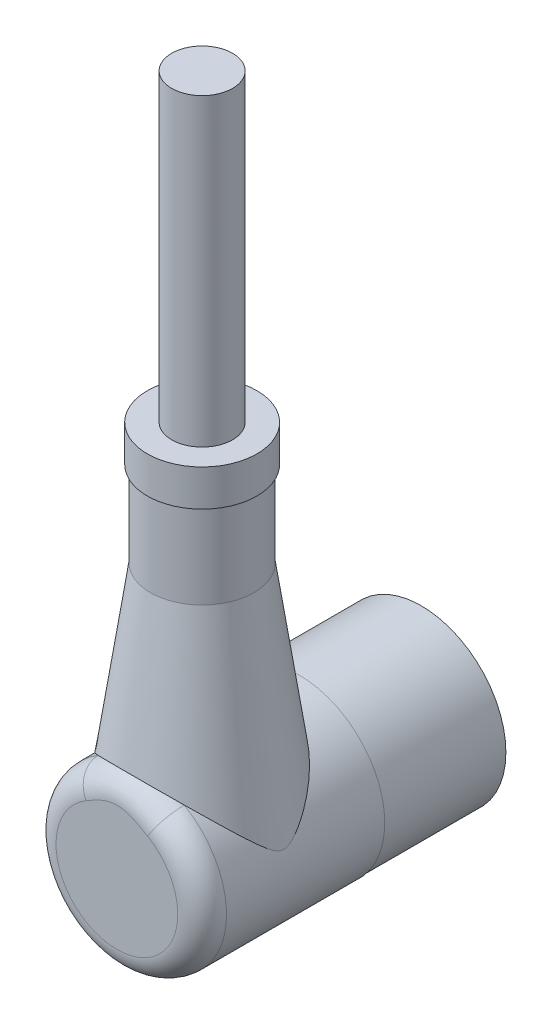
ISO-10303-21;
HEADER;
FILE_DESCRIPTION(('STEP AP214'),'2;1');
FILE_NAME('part.step','',(''),(''),'','','');
FILE_SCHEMA(('AUTOMOTIVE_DESIGN { 1 0 10303 214 1 1 1 1 }'));
ENDSEC;
DATA;
#1=APPLICATION_CONTEXT('core data for automotive mechanical design processes');
#2=APPLICATION_PROTOCOL_DEFINITION('international standard','automotive_design',2000,#1);
#3=PRODUCT_CONTEXT('',#1,'mechanical');
#4=PRODUCT('Part','Part','',(#3));
#5=PRODUCT_RELATED_PRODUCT_CATEGORY('part','',(#4));
#6=PRODUCT_DEFINITION_FORMATION('','',#4);
#7=PRODUCT_DEFINITION_CONTEXT('part definition',#1,'design');
#8=PRODUCT_DEFINITION('design','',#6,#7);
#9=PRODUCT_DEFINITION_SHAPE('','',#8);
#10=(LENGTH_UNIT() NAMED_UNIT(*) SI_UNIT(.MILLI.,.METRE.));
#11=(NAMED_UNIT(*) PLANE_ANGLE_UNIT() SI_UNIT($,.RADIAN.));
#12=(NAMED_UNIT(*) SI_UNIT($,.STERADIAN.) SOLID_ANGLE_UNIT());
#13=UNCERTAINTY_MEASURE_WITH_UNIT(LENGTH_MEASURE(1.E-05),#10,'distance_accuracy_value','');
#14=(GEOMETRIC_REPRESENTATION_CONTEXT(3) GLOBAL_UNCERTAINTY_ASSIGNED_CONTEXT((#13)) GLOBAL_UNIT_ASSIGNED_CONTEXT((#10,
#11,#12)) REPRESENTATION_CONTEXT('',''));
#15=CARTESIAN_POINT('',(0.,0.,0.));
#16=DIRECTION('',(0.,0.,1.));
#17=DIRECTION('',(1.,0.,0.));
#18=AXIS2_PLACEMENT_3D('',#15,#16,#17);
#19=CARTESIAN_POINT('',(2.22044604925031E-13,29.0000000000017,17.9999999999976));
#20=DIRECTION('',(0.,-1.00000000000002,0.));
#21=DIRECTION('',(0.,0.,-1.));
#22=AXIS2_PLACEMENT_3D('',#19,#20,#21);
#23=PLANE('',#22);
#24=CARTESIAN_POINT('',(2.22044604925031E-13,29.0000000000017,17.9999999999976));
#25=DIRECTION('',(0.,-1.00000000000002,0.));
#26=DIRECTION('',(0.,0.,-1.));
#27=AXIS2_PLACEMENT_3D('',#24,#25,#26);
#28=CIRCLE('',#27,4.5);
#29=CARTESIAN_POINT('',(2.22044604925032E-13,29.0000000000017,13.4999999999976));
#30=VERTEX_POINT('',#29);
#31=EDGE_CURVE('E174',#30,#30,#28,.T.);
#32=ORIENTED_EDGE('',*,*,#31,.F.);
#33=EDGE_LOOP('',(#32));
#34=FACE_BOUND('',#33,.T.);
#35=CARTESIAN_POINT('',(2.22044604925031E-13,29.0000000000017,17.9999999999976));
#36=DIRECTION('',(0.,-1.00000000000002,0.));
#37=DIRECTION('',(0.,0.,-1.));
#38=AXIS2_PLACEMENT_3D('',#35,#36,#37);
#39=CIRCLE('',#38,2.5);
#40=CARTESIAN_POINT('',(2.22044604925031E-13,29.0000000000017,15.4999999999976));
#41=VERTEX_POINT('',#40);
#42=EDGE_CURVE('E11',#41,#41,#39,.F.);
#43=ORIENTED_EDGE('',*,*,#42,.F.);
#44=EDGE_LOOP('',(#43));
#45=FACE_BOUND('',#44,.T.);
#46=ADVANCED_FACE('F40',(#34,#45),#23,.F.);
#47=CARTESIAN_POINT('',(-2.77555756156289E-13,6.66133814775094E-13,24.9999999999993));
#48=DIRECTION('',(0.,0.,-1.));
#49=DIRECTION('',(-1.00000000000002,0.,0.));
#50=AXIS2_PLACEMENT_3D('',#47,#48,#49);
#51=CYLINDRICAL_SURFACE('',#50,7.);
#52=CARTESIAN_POINT('',(7.00000000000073,-2.22044604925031E-13,18.));
#53=VERTEX_POINT('',#52);
#54=VERTEX_LOOP('',#53);
#55=FACE_BOUND('',#54,.T.);
#56=CARTESIAN_POINT('',(-6.99999999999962,2.22044604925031E-13,17.9999999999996));
#57=VERTEX_POINT('',#56);
#58=VERTEX_LOOP('',#57);
#59=FACE_BOUND('',#58,.T.);
#60=CARTESIAN_POINT('',(0.,0.,9.9999999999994));
#61=DIRECTION('',(0.,0.,1.));
#62=DIRECTION('',(1.00000000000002,0.,0.));
#63=AXIS2_PLACEMENT_3D('',#60,#61,#62);
#64=CIRCLE('',#63,7.);
#65=CARTESIAN_POINT('',(7.00000000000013,0.,9.9999999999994));
#66=VERTEX_POINT('',#65);
#67=EDGE_CURVE('E185',#66,#66,#64,.T.);
#68=ORIENTED_EDGE('',*,*,#67,.T.);
#69=EDGE_LOOP('',(#68));
#70=FACE_BOUND('',#69,.T.);
#71=CARTESIAN_POINT('',(-4.54375250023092,5.32487682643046,13.7387303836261));
#72=CARTESIAN_POINT('',(-4.83395577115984,5.07724279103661,13.9957668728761));
#73=CARTESIAN_POINT('',(-5.09517252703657,4.81332348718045,14.2708337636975));
#74=CARTESIAN_POINT('',(-5.44488906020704,4.40291523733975,14.7027802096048));
#75=CARTESIAN_POINT('',(-5.55455541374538,4.26350482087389,14.8501860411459));
#76=CARTESIAN_POINT('',(-5.76027747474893,3.98116356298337,15.1509861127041));
#77=CARTESIAN_POINT('',(-5.85633808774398,3.83823401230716,15.3043781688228));
#78=CARTESIAN_POINT('',(-6.04022666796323,3.54226972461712,15.6258573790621));
#79=CARTESIAN_POINT('',(-6.12727756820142,3.38912199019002,15.7942844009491));
#80=CARTESIAN_POINT('',(-6.24679832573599,3.15989683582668,16.0525402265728));
#81=CARTESIAN_POINT('',(-6.28480651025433,3.08354651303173,16.1395905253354));
#82=CARTESIAN_POINT('',(-6.357068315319,2.93168423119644,16.3159101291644));
#83=CARTESIAN_POINT('',(-6.39132262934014,2.85617211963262,16.4051790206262));
#84=CARTESIAN_POINT('',(-6.47091321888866,2.67231844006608,16.6282992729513));
#85=CARTESIAN_POINT('',(-6.51407953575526,2.56488857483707,16.7637335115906));
#86=CARTESIAN_POINT('',(-6.57181244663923,2.41128879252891,16.9742118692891));
#87=CARTESIAN_POINT('',(-6.58987839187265,2.36137466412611,17.0455465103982));
#88=CARTESIAN_POINT('',(-6.62331286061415,2.26588986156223,17.191636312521));
#89=CARTESIAN_POINT('',(-6.63868460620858,2.22031402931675,17.2663872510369));
#90=CARTESIAN_POINT('',(-6.66345439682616,2.14467915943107,17.4059256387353));
#91=CARTESIAN_POINT('',(-6.67343264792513,2.11331917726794,17.4698880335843));
#92=CARTESIAN_POINT('',(-6.69051207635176,2.05860860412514,17.601506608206));
#93=CARTESIAN_POINT('',(-6.69762094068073,2.03523663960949,17.6691523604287));
#94=CARTESIAN_POINT('',(-6.70701457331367,2.00403985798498,17.7941576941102));
#95=CARTESIAN_POINT('',(-6.70997579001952,1.99405306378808,17.8509021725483));
#96=CARTESIAN_POINT('',(-6.71303282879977,1.98374024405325,17.9653108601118));
#97=CARTESIAN_POINT('',(-6.71313306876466,1.98339932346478,18.0229735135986));
#98=CARTESIAN_POINT('',(-6.71046508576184,1.99240406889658,18.1372868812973));
#99=CARTESIAN_POINT('',(-6.70770334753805,2.00172783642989,18.1939395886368));
#100=CARTESIAN_POINT('',(-6.69971534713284,2.02829994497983,18.3051971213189));
#101=CARTESIAN_POINT('',(-6.69448381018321,2.04556524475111,18.3597972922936));
#102=CARTESIAN_POINT('',(-6.68037628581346,2.09123857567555,18.4809694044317));
#103=CARTESIAN_POINT('',(-6.67089750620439,2.12139688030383,18.5467897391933));
#104=CARTESIAN_POINT('',(-6.64952393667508,2.18747450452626,18.6751131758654));
#105=CARTESIAN_POINT('',(-6.63762395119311,2.22340617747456,18.7376087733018));
#106=CARTESIAN_POINT('',(-6.61176894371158,2.29915814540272,18.8604457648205));
#107=CARTESIAN_POINT('',(-6.5977978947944,2.33900786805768,18.9207653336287));
#108=CARTESIAN_POINT('',(-6.56815441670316,2.42100261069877,19.0392809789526));
#109=CARTESIAN_POINT('',(-6.55248357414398,2.4631454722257,19.0974789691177));
#110=CARTESIAN_POINT('',(-6.50590613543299,2.58461558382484,19.2600577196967));
#111=CARTESIAN_POINT('',(-6.47316901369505,2.66571436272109,19.3625863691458));
#112=CARTESIAN_POINT('',(-6.40294052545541,2.83026627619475,19.5640827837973));
#113=CARTESIAN_POINT('',(-6.36544692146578,2.91372050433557,19.6630488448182));
#114=CARTESIAN_POINT('',(-6.24599192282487,3.16576788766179,19.9562174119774));
#115=CARTESIAN_POINT('',(-6.15714159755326,3.33581745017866,20.1464036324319));
#116=CARTESIAN_POINT('',(-5.96155628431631,3.67397292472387,20.518189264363));
#117=CARTESIAN_POINT('',(-5.85486169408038,3.8420823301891,20.699806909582));
#118=CARTESIAN_POINT('',(-5.62311352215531,4.17390700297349,21.0548710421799));
#119=CARTESIAN_POINT('',(-5.49807652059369,4.3376260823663,21.2283247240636));
#120=CARTESIAN_POINT('',(-5.24947917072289,4.63405520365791,21.5406042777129));
#121=CARTESIAN_POINT('',(-5.12859728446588,4.76768881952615,21.6806791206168));
#122=CARTESIAN_POINT('',(-4.87279976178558,5.02884409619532,21.9535080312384));
#123=CARTESIAN_POINT('',(-4.73788110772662,5.15636443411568,22.0862605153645));
#124=CARTESIAN_POINT('',(-4.31192923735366,5.52708067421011,22.4713008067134));
#125=CARTESIAN_POINT('',(-3.99907274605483,5.75920179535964,22.7111779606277));
#126=CARTESIAN_POINT('',(-3.40710784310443,6.12188414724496,23.085139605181));
#127=CARTESIAN_POINT('',(-3.14152826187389,6.26297392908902,23.2303300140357));
#128=CARTESIAN_POINT('',(-2.72148544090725,6.45113238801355,23.423748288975));
#129=CARTESIAN_POINT('',(-2.57780881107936,6.50995443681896,23.4841754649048));
#130=CARTESIAN_POINT('',(-2.283793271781,6.61882407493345,23.5959667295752));
#131=CARTESIAN_POINT('',(-2.13345732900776,6.66887552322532,23.6473348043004));
#132=CARTESIAN_POINT('',(-1.82535334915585,6.7597439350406,23.7405629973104));
#133=CARTESIAN_POINT('',(-1.66752597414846,6.80046343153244,23.7823227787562));
#134=CARTESIAN_POINT('',(-1.34697352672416,6.87114191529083,23.8547904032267));
#135=CARTESIAN_POINT('',(-1.18424843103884,6.90110085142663,23.8854981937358));
#136=CARTESIAN_POINT('',(-0.855464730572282,6.94951538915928,23.9351162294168));
#137=CARTESIAN_POINT('',(-0.689409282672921,6.96798139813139,23.9540371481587));
#138=CARTESIAN_POINT('',(-0.355473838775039,6.99297198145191,23.9796422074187));
#139=CARTESIAN_POINT('',(-0.187594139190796,6.99949846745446,23.9863283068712));
#140=CARTESIAN_POINT('',(0.123775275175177,7.00037717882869,23.9872285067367));
#141=CARTESIAN_POINT('',(0.267260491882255,6.99636224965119,23.9831153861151));
#142=CARTESIAN_POINT('',(0.553176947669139,6.97957716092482,23.9659182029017));
#143=CARTESIAN_POINT('',(0.695608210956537,6.96680720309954,23.9528343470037));
#144=CARTESIAN_POINT('',(0.978359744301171,6.93275506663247,23.917939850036));
#145=CARTESIAN_POINT('',(1.11868000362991,6.91147284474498,23.8961291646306));
#146=CARTESIAN_POINT('',(1.39626983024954,6.86078286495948,23.8441691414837));
#147=CARTESIAN_POINT('',(1.53353927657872,6.83137478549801,23.8140194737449));
#148=CARTESIAN_POINT('',(1.8016603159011,6.76555320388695,23.7465186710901));
#149=CARTESIAN_POINT('',(1.93258418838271,6.72928271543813,23.7093145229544));
#150=CARTESIAN_POINT('',(2.19012684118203,6.64992704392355,23.6278871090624));
#151=CARTESIAN_POINT('',(2.3167440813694,6.60683945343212,23.5836613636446));
#152=CARTESIAN_POINT('',(2.6893463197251,6.46819334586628,23.4412917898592));
#153=CARTESIAN_POINT('',(2.92824585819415,6.36321021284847,23.3334133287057));
#154=CARTESIAN_POINT('',(3.32422835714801,6.16320162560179,23.1276184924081));
#155=CARTESIAN_POINT('',(3.48630574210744,6.07281773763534,23.0345427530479));
#156=CARTESIAN_POINT('',(3.79851829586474,5.88257178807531,22.8383890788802));
#157=CARTESIAN_POINT('',(3.94864883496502,5.78270608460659,22.7353073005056));
#158=CARTESIAN_POINT('',(4.23714829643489,5.57479036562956,22.5203511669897));
#159=CARTESIAN_POINT('',(4.37548647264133,5.46672026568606,22.4084552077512));
#160=CARTESIAN_POINT('',(4.6401169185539,5.24397044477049,22.1773254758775));
#161=CARTESIAN_POINT('',(4.76640965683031,5.12929098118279,22.058091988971));
#162=CARTESIAN_POINT('',(5.05147249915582,4.85134052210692,21.7682793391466));
#163=CARTESIAN_POINT('',(5.20512732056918,4.68569682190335,21.5949303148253));
#164=CARTESIAN_POINT('',(5.49120922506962,4.3469320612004,21.2381979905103));
#165=CARTESIAN_POINT('',(5.62362354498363,4.17380658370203,21.0548087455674));
#166=CARTESIAN_POINT('',(5.86772132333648,3.82300486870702,20.6793445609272));
#167=CARTESIAN_POINT('',(5.97943109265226,3.64533473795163,20.4872810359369));
#168=CARTESIAN_POINT('',(6.13186027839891,3.37799167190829,20.1923725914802));
#169=CARTESIAN_POINT('',(6.18013710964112,3.28876039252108,20.0929603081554));
#170=CARTESIAN_POINT('',(6.27165975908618,3.11067354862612,19.8915240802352));
#171=CARTESIAN_POINT('',(6.31490629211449,3.02181793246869,19.7895005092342));
#172=CARTESIAN_POINT('',(6.40158543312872,2.83403370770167,19.5687420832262));
#173=CARTESIAN_POINT('',(6.44430799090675,2.73530124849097,19.4495619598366));
#174=CARTESIAN_POINT('',(6.52283146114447,2.54232080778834,19.2053445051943));
#175=CARTESIAN_POINT('',(6.55863622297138,2.44807035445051,19.0803104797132));
#176=CARTESIAN_POINT('',(6.60927480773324,2.3066625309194,18.8724929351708));
#177=CARTESIAN_POINT('',(6.62675510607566,2.2557963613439,18.7929131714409));
#178=CARTESIAN_POINT('',(6.65804739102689,2.16167154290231,18.6285111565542));
#179=CARTESIAN_POINT('',(6.67186269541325,2.11840602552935,18.5436937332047));
#180=CARTESIAN_POINT('',(6.69048818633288,2.05864141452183,18.3975815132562));
#181=CARTESIAN_POINT('',(6.69676163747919,2.03805240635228,18.3382069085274));
#182=CARTESIAN_POINT('',(6.7064172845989,2.00605377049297,18.2168922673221));
#183=CARTESIAN_POINT('',(6.70981000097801,1.99461075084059,18.1549624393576));
#184=CARTESIAN_POINT('',(6.71318803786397,1.98321829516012,18.0292190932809));
#185=CARTESIAN_POINT('',(6.71313710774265,1.98339113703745,17.9653926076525));
#186=CARTESIAN_POINT('',(6.7095433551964,1.99550935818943,17.8389424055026));
#187=CARTESIAN_POINT('',(6.70599395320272,2.00747691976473,17.7763211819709));
#188=CARTESIAN_POINT('',(6.69400593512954,2.047154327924,17.6294648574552));
#189=CARTESIAN_POINT('',(6.68418025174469,2.07924412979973,17.5465936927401));
#190=CARTESIAN_POINT('',(6.66053113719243,2.15380181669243,17.386130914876));
#191=CARTESIAN_POINT('',(6.64668640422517,2.19632480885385,17.3085702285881));
#192=CARTESIAN_POINT('',(6.61691603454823,2.28439577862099,17.1621327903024));
#193=CARTESIAN_POINT('',(6.60116504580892,2.32960927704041,17.0930142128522));
#194=CARTESIAN_POINT('',(6.56741130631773,2.42313696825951,16.9574550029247));
#195=CARTESIAN_POINT('',(6.54940720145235,2.47145301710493,16.8910160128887));
#196=CARTESIAN_POINT('',(6.4923018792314,2.61937950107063,16.6944117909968));
#197=CARTESIAN_POINT('',(6.45016863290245,2.72178297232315,16.5672418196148));
#198=CARTESIAN_POINT('',(6.3584273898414,2.92975388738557,16.3174136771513));
#199=CARTESIAN_POINT('',(6.30878836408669,3.0353329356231,16.1947769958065));
#200=CARTESIAN_POINT('',(6.2024228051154,3.24715025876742,15.9534903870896));
#201=CARTESIAN_POINT('',(6.14570443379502,3.35338764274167,15.8348360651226));
#202=CARTESIAN_POINT('',(5.98096533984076,3.64317224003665,15.5149913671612));
#203=CARTESIAN_POINT('',(5.86581259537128,3.82631121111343,15.317049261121));
#204=CARTESIAN_POINT('',(5.61358463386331,4.18764158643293,14.930451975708));
#205=CARTESIAN_POINT('',(5.47649057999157,4.3658285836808,14.7418049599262));
#206=CARTESIAN_POINT('',(5.18017489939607,4.7135701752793,14.3758303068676));
#207=CARTESIAN_POINT('',(5.02103826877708,4.88315466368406,14.1984628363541));
#208=CARTESIAN_POINT('',(4.67964754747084,5.21123460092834,13.8565725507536));
#209=CARTESIAN_POINT('',(4.49741317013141,5.36973932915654,13.6920389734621));
#210=CARTESIAN_POINT('',(4.06364440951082,5.70778319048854,13.3419637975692));
#211=CARTESIAN_POINT('',(3.80584680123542,5.88365107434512,13.1604251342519));
#212=CARTESIAN_POINT('',(3.39237171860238,6.12513920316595,12.9115757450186));
#213=CARTESIAN_POINT('',(3.25008078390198,6.20191747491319,12.8325345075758));
#214=CARTESIAN_POINT('',(2.95681698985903,6.34696375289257,12.6833193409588));
#215=CARTESIAN_POINT('',(2.80584921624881,6.41523667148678,12.613140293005));
#216=CARTESIAN_POINT('',(2.52083682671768,6.53185358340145,12.4933321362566));
#217=CARTESIAN_POINT('',(2.38800329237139,6.58163494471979,12.4422150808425));
#218=CARTESIAN_POINT('',(2.11713915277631,6.67369196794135,12.347722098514));
#219=CARTESIAN_POINT('',(1.97911107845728,6.71597122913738,12.3043424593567));
#220=CARTESIAN_POINT('',(1.69851014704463,6.79236331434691,12.2259833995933));
#221=CARTESIAN_POINT('',(1.55593841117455,6.82647813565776,12.1910019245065));
#222=CARTESIAN_POINT('',(1.26707633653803,6.88594643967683,12.1300345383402));
#223=CARTESIAN_POINT('',(1.12078596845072,6.91129985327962,12.1040486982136));
#224=CARTESIAN_POINT('',(0.824735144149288,6.9528607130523,12.0614560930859));
#225=CARTESIAN_POINT('',(0.674960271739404,6.96901831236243,12.0449004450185));
#226=CARTESIAN_POINT('',(0.373910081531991,6.99163607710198,12.0217265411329));
#227=CARTESIAN_POINT('',(0.222634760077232,6.99809621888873,12.0151083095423));
#228=CARTESIAN_POINT('',(-0.0800830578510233,7.00117801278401,12.0119510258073));
#229=CARTESIAN_POINT('',(-0.231525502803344,6.99780213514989,12.0154094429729));
#230=CARTESIAN_POINT('',(-0.533307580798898,6.9812904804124,12.0323263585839));
#231=CARTESIAN_POINT('',(-0.683647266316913,6.9681551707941,12.0457843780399));
#232=CARTESIAN_POINT('',(-0.969122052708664,6.93394968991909,12.0808359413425));
#233=CARTESIAN_POINT('',(-1.10445111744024,6.91366070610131,12.1016286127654));
#234=CARTESIAN_POINT('',(-1.37236112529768,6.86550476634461,12.1509902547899));
#235=CARTESIAN_POINT('',(-1.50494102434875,6.83763498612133,12.1795621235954));
#236=CARTESIAN_POINT('',(-1.76661781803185,6.77474550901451,12.2440533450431));
#237=CARTESIAN_POINT('',(-1.89571335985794,6.73972307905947,12.2799755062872));
#238=CARTESIAN_POINT('',(-2.14978863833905,6.66303460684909,12.3586609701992));
#239=CARTESIAN_POINT('',(-2.27476752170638,6.62136719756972,12.4014256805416));
#240=CARTESIAN_POINT('',(-2.55927370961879,6.51764983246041,12.5079186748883));
#241=CARTESIAN_POINT('',(-2.71711160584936,6.45333691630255,12.5739836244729));
#242=CARTESIAN_POINT('',(-3.02403982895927,6.31534274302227,12.7158392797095));
#243=CARTESIAN_POINT('',(-3.17312690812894,6.24165803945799,12.7916335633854));
#244=CARTESIAN_POINT('',(-3.60648186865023,6.00838619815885,13.0317970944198));
#245=CARTESIAN_POINT('',(-3.87723705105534,5.8364330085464,13.2090990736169));
#246=CARTESIAN_POINT('',(-4.20107562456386,5.59991158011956,13.4536952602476));
#247=CARTESIAN_POINT('',(-4.27177635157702,5.54614371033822,13.5093418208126));
#248=CARTESIAN_POINT('',(-4.41006855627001,5.43682351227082,13.6225916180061));
#249=CARTESIAN_POINT('',(-4.4776622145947,5.38127248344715,13.680193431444));
#250=CARTESIAN_POINT('',(-4.54375250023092,5.32487682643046,13.7387303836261));
#251=B_SPLINE_CURVE_WITH_KNOTS('',3,(#71,#72,#73,#74,#75,#76,#77,#78,#79,#80,#81,#82,#83,#84,
#85,#86,#87,#88,#89,#90,#91,#92,#93,#94,#95,#96,#97,#98,#99,#100,#101,#102,#103,#104,#105,#106,
#107,#108,#109,#110,#111,#112,#113,#114,#115,#116,#117,#118,#119,#120,#121,#122,#123,#124,#125,
#126,#127,#128,#129,#130,#131,#132,#133,#134,#135,#136,#137,#138,#139,#140,#141,#142,#143,#144,
#145,#146,#147,#148,#149,#150,#151,#152,#153,#154,#155,#156,#157,#158,#159,#160,#161,#162,#163,
#164,#165,#166,#167,#168,#169,#170,#171,#172,#173,#174,#175,#176,#177,#178,#179,#180,#181,#182,
#183,#184,#185,#186,#187,#188,#189,#190,#191,#192,#193,#194,#195,#196,#197,#198,#199,#200,#201,
#202,#203,#204,#205,#206,#207,#208,#209,#210,#211,#212,#213,#214,#215,#216,#217,#218,#219,#220,
#221,#222,#223,#224,#225,#226,#227,#228,#229,#230,#231,#232,#233,#234,#235,#236,#237,#238,#239,
#240,#241,#242,#243,#244,#245,#246,#247,#248,#249,#250),.UNSPECIFIED.,.T.,.F.,(4,2,2,2,2,2,2,2,
2,2,2,2,2,2,2,2,2,2,2,2,2,2,2,2,2,2,2,2,2,2,2,2,2,2,2,2,2,2,2,2,2,2,2,2,2,2,2,2,2,2,2,2,2,2,2,2,
2,2,2,2,2,2,2,2,2,2,2,2,2,2,2,2,2,2,2,2,2,2,2,2,2,2,2,2,2,2,2,2,2,4),(0.,1.37965627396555,
2.0712413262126,2.76257639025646,3.49316260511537,3.8586928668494,4.22415548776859,
4.75807822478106,5.02471283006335,5.29102634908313,5.50645834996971,5.72130932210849,
5.8936226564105,6.06566989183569,6.23732814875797,6.40935468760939,6.6278640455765,
6.84684733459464,7.06762343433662,7.28819520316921,7.69223970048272,8.09647497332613,
8.90607090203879,9.71385819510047,10.5209197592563,11.204997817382,11.8892232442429,
13.2538744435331,14.2517545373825,14.7510185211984,15.2500622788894,15.7541021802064,
16.2581444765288,16.7617296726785,17.2652342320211,17.6954956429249,18.1257471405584,
18.5560008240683,18.9862715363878,19.4084044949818,19.8306868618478,20.674733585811,
21.296817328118,21.9191409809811,22.5430405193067,23.1669157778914,24.0200040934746,
24.8736031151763,25.7261098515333,26.1521473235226,26.5781241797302,27.0596078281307,
27.5408227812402,27.8287342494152,28.1163841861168,28.3052891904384,28.4935013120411,
28.6836950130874,28.8742470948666,29.1409536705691,29.4091004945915,29.6611618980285,
29.9133755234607,30.4188291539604,30.926432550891,31.4334560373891,32.3121029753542,
33.1915083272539,34.0676124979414,34.9429739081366,36.0217500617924,36.5611575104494,
37.1002519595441,37.5521711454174,38.0038729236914,38.4554640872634,38.90705881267,
39.3610786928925,39.8150996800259,40.2690066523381,40.7228918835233,41.1376699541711,
41.552602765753,41.967694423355,42.3828715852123,42.93042020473,43.4781707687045,
44.572346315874,44.8867705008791,45.2009705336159),.UNSPECIFIED.);
#252=CARTESIAN_POINT('',(3.53927723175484,6.03933081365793,22.9999999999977));
#253=VERTEX_POINT('',#252);
#254=CARTESIAN_POINT('',(-3.53927723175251,6.03933081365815,22.9999999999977));
#255=VERTEX_POINT('',#254);
#256=EDGE_CURVE('E202',#253,#255,#251,.T.);
#257=ORIENTED_EDGE('',*,*,#256,.F.);
#258=CARTESIAN_POINT('',(-1.66533453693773E-13,6.66133814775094E-13,22.9999999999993));
#259=DIRECTION('',(0.,0.,1.));
#260=DIRECTION('',(1.00000000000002,0.,0.));
#261=AXIS2_PLACEMENT_3D('',#258,#259,#260);
#262=CIRCLE('',#261,7.);
#263=EDGE_CURVE('E50',#253,#255,#262,.F.);
#264=ORIENTED_EDGE('',*,*,#263,.T.);
#265=EDGE_LOOP('',(#257,#264));
#266=FACE_BOUND('',#265,.T.);
#267=ADVANCED_FACE('F98',(#55,#59,#70,#266),#51,.T.);
#268=CARTESIAN_POINT('',(0.,0.,9.9999999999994));
#269=DIRECTION('',(0.,0.,-1.));
#270=DIRECTION('',(-1.00000000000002,0.,0.));
#271=AXIS2_PLACEMENT_3D('',#268,#269,#270);
#272=CYLINDRICAL_SURFACE('',#271,6.95);
#273=CARTESIAN_POINT('',(0.,0.,9.9999999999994));
#274=DIRECTION('',(0.,0.,1.));
#275=DIRECTION('',(1.00000000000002,0.,0.));
#276=AXIS2_PLACEMENT_3D('',#273,#274,#275);
#277=CIRCLE('',#276,6.95);
#278=CARTESIAN_POINT('',(6.95000000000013,0.,9.9999999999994));
#279=VERTEX_POINT('',#278);
#280=EDGE_CURVE('E196',#279,#279,#277,.T.);
#281=ORIENTED_EDGE('',*,*,#280,.F.);
#282=EDGE_LOOP('',(#281));
#283=FACE_BOUND('',#282,.T.);
#284=CARTESIAN_POINT('',(1.66533453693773E-13,0.,-6.10622663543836E-13));
#285=DIRECTION('',(0.,0.,1.));
#286=DIRECTION('',(1.00000000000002,0.,0.));
#287=AXIS2_PLACEMENT_3D('',#284,#285,#286);
#288=CIRCLE('',#287,6.95);
#289=CARTESIAN_POINT('',(6.9500000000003,0.,-6.10622663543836E-13));
#290=VERTEX_POINT('',#289);
#291=EDGE_CURVE('E190',#290,#290,#288,.T.);
#292=ORIENTED_EDGE('',*,*,#291,.T.);
#293=EDGE_LOOP('',(#292));
#294=FACE_BOUND('',#293,.T.);
#295=ADVANCED_FACE('F104',(#283,#294),#272,.T.);
#296=CARTESIAN_POINT('',(1.66533453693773E-13,0.,-6.10622663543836E-13));
#297=DIRECTION('',(0.,0.,1.));
#298=DIRECTION('',(1.00000000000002,0.,0.));
#299=AXIS2_PLACEMENT_3D('',#296,#297,#298);
#300=PLANE('',#299);
#301=CARTESIAN_POINT('',(1.66533453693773E-13,0.,-6.10622663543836E-13));
#302=DIRECTION('',(0.,0.,-1.));
#303=DIRECTION('',(-1.00000000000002,0.,0.));
#304=AXIS2_PLACEMENT_3D('',#301,#302,#303);
#305=CIRCLE('',#304,6.);
#306=CARTESIAN_POINT('',(-5.99999999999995,0.,-6.10622663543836E-13));
#307=VERTEX_POINT('',#306);
#308=EDGE_CURVE('E216',#307,#307,#305,.T.);
#309=ORIENTED_EDGE('',*,*,#308,.F.);
#310=EDGE_LOOP('',(#309));
#311=FACE_BOUND('',#310,.T.);
#312=ORIENTED_EDGE('',*,*,#291,.F.);
#313=EDGE_LOOP('',(#312));
#314=FACE_BOUND('',#313,.T.);
#315=ADVANCED_FACE('F92',(#311,#314),#300,.F.);
#316=CARTESIAN_POINT('',(0.,0.,9.9999999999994));
#317=DIRECTION('',(0.,0.,1.));
#318=DIRECTION('',(1.00000000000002,0.,0.));
#319=AXIS2_PLACEMENT_3D('',#316,#317,#318);
#320=PLANE('',#319);
#321=ORIENTED_EDGE('',*,*,#67,.F.);
#322=EDGE_LOOP('',(#321));
#323=FACE_BOUND('',#322,.T.);
#324=ORIENTED_EDGE('',*,*,#280,.T.);
#325=EDGE_LOOP('',(#324));
#326=FACE_BOUND('',#325,.T.);
#327=ADVANCED_FACE('F82',(#323,#326),#320,.F.);
#328=CARTESIAN_POINT('',(-2.77555756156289E-13,6.66133814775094E-13,24.9999999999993));
#329=DIRECTION('',(0.,0.,1.));
#330=DIRECTION('',(1.00000000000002,0.,0.));
#331=AXIS2_PLACEMENT_3D('',#328,#329,#330);
#332=PLANE('',#331);
#333=CARTESIAN_POINT('',(-2.77555756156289E-13,6.66133814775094E-13,24.9999999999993));
#334=DIRECTION('',(0.,0.,1.));
#335=DIRECTION('',(1.00000000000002,0.,0.));
#336=AXIS2_PLACEMENT_3D('',#333,#334,#335);
#337=CIRCLE('',#336,5.);
#338=CARTESIAN_POINT('',(-2.52805516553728,4.31380772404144,24.9999999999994));
#339=VERTEX_POINT('',#338);
#340=CARTESIAN_POINT('',(2.52805516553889,4.31380772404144,24.9999999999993));
#341=VERTEX_POINT('',#340);
#342=EDGE_CURVE('E203',#339,#341,#337,.T.);
#343=ORIENTED_EDGE('',*,*,#342,.T.);
#344=CARTESIAN_POINT('',(-4.53708122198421,3.35138957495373,24.9999999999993));
#345=CARTESIAN_POINT('',(-4.84093337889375,4.51971322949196,24.9999999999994));
#346=CARTESIAN_POINT('',(-4.98250559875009,5.06406405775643,23.931849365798));
#347=CARTESIAN_POINT('',(-5.12407781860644,5.6084148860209,22.8636987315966));
#348=CARTESIAN_POINT('',(-4.95214963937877,4.9473441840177,21.8683432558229));
#349=CARTESIAN_POINT('',(-4.47603083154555,3.36727842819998,24.9999999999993));
#350=CARTESIAN_POINT('',(-4.79925254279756,4.51889188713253,24.9999999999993));
#351=CARTESIAN_POINT('',(-4.95192362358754,5.06401811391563,23.9464952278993));
#352=CARTESIAN_POINT('',(-5.10475864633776,5.60914394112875,22.8929153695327));
#353=CARTESIAN_POINT('',(-4.92603499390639,4.97348602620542,21.895632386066));
#354=CARTESIAN_POINT('',(-4.41545072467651,3.38487381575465,24.9999999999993));
#355=CARTESIAN_POINT('',(-4.75551672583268,4.51977662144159,24.9999999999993));
#356=CARTESIAN_POINT('',(-4.91867545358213,5.06533391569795,23.9611824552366));
#357=CARTESIAN_POINT('',(-5.08201296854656,5.61087787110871,22.9222917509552));
#358=CARTESIAN_POINT('',(-4.89878597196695,5.00034829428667,21.9236545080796));
#359=CARTESIAN_POINT('',(-4.2952618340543,3.42299061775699,24.9999999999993));
#360=CARTESIAN_POINT('',(-4.66487645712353,4.5248326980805,24.9999999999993));
#361=CARTESIAN_POINT('',(-4.84765846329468,5.07066503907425,23.9905306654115));
#362=CARTESIAN_POINT('',(-5.03061188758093,5.61648443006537,22.980989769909));
#363=CARTESIAN_POINT('',(-4.84206161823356,5.05529804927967,21.9809375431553));
#364=CARTESIAN_POINT('',(-4.23565238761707,3.44350993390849,24.9999999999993));
#365=CARTESIAN_POINT('',(-4.61798825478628,4.5289856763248,24.9999999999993));
#366=CARTESIAN_POINT('',(-4.80989288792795,5.07467843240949,24.0051916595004));
#367=CARTESIAN_POINT('',(-5.00198878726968,5.62034514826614,23.0103127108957));
#368=CARTESIAN_POINT('',(-4.81258789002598,5.08338464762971,22.0101975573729));
#369=CARTESIAN_POINT('',(-4.11752846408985,3.48694539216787,24.9999999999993));
#370=CARTESIAN_POINT('',(-4.52186751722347,4.54040229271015,24.9999999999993));
#371=CARTESIAN_POINT('',(-4.73072756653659,5.08536447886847,24.0343551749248));
#372=CARTESIAN_POINT('',(-4.93977861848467,5.6303011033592,23.0686401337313));
#373=CARTESIAN_POINT('',(-4.75151229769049,5.14051824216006,22.0696780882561));
#374=CARTESIAN_POINT('',(-4.05901120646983,3.5098540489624,24.9999999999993));
#375=CARTESIAN_POINT('',(-4.4726516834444,4.54764181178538,24.9999999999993));
#376=CARTESIAN_POINT('',(-4.68933923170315,5.09202900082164,24.0488580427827));
#377=CARTESIAN_POINT('',(-4.90622929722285,5.63637904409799,23.0976480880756));
#378=CARTESIAN_POINT('',(-4.71991718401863,5.16956205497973,22.0998954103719));
#379=CARTESIAN_POINT('',(-3.9428201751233,3.55773978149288,24.9999999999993));
#380=CARTESIAN_POINT('',(-4.37224524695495,4.56498178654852,24.9999999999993));
#381=CARTESIAN_POINT('',(-4.60340090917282,5.10787119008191,24.0776911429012));
#382=CARTESIAN_POINT('',(-4.83475850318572,5.65072318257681,23.1553145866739));
#383=CARTESIAN_POINT('',(-4.65450468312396,5.22853354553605,22.1612103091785));
#384=CARTESIAN_POINT('',(-3.88514657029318,3.58271726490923,24.9999999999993));
#385=CARTESIAN_POINT('',(-4.32105889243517,4.57507019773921,24.9999999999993));
#386=CARTESIAN_POINT('',(-4.55885029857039,5.11704935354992,24.0920213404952));
#387=CARTESIAN_POINT('',(-4.79685336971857,5.65898021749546,23.1839773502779));
#388=CARTESIAN_POINT('',(-4.62068685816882,5.25846139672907,22.1923080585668));
#389=CARTESIAN_POINT('',(-3.71413994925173,3.65984943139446,24.9999999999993));
#390=CARTESIAN_POINT('',(-4.1662825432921,4.60898397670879,24.9999999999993));
#391=CARTESIAN_POINT('',(-4.42187097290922,5.14792809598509,24.1344660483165));
#392=CARTESIAN_POINT('',(-4.67828115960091,5.68668810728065,23.2686769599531));
#393=CARTESIAN_POINT('',(-4.51639107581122,5.34889148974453,22.2862172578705));
#394=CARTESIAN_POINT('',(-3.60195000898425,3.71453561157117,24.9999999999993));
#395=CARTESIAN_POINT('',(-4.06006382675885,4.63664081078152,24.9999999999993));
#396=CARTESIAN_POINT('',(-4.32551416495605,5.17305729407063,24.1622517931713));
#397=CARTESIAN_POINT('',(-4.59182260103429,5.70922684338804,23.3242705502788));
#398=CARTESIAN_POINT('',(-4.44261958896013,5.41046726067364,22.350089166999));
#399=CARTESIAN_POINT('',(-3.37986793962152,3.82852377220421,24.9999999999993));
#400=CARTESIAN_POINT('',(-3.84343107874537,4.70006703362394,24.9999999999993));
#401=CARTESIAN_POINT('',(-4.12466659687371,5.23084203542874,24.2167197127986));
#402=CARTESIAN_POINT('',(-4.40675900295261,5.76137056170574,23.4332073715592));
#403=CARTESIAN_POINT('',(-4.28579501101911,5.53552048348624,22.4796635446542));
#404=CARTESIAN_POINT('',(-3.26997781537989,3.88782958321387,24.9999999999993));
#405=CARTESIAN_POINT('',(-3.7329978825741,4.73578941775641,24.9999999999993));
#406=CARTESIAN_POINT('',(-4.02016908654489,5.26350386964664,24.2434009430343));
#407=CARTESIAN_POINT('',(-4.30820303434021,5.7909338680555,23.4865935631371));
#408=CARTESIAN_POINT('',(-4.20273419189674,5.59899948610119,22.5453675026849));
#409=CARTESIAN_POINT('',(-3.04765084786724,4.01152706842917,24.9999999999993));
#410=CARTESIAN_POINT('',(-3.50472595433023,4.81471531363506,24.9999999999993));
#411=CARTESIAN_POINT('',(-3.80027285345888,5.33595528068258,24.2964810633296));
#412=CARTESIAN_POINT('',(-4.09674229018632,5.85689149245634,23.5927395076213));
#413=CARTESIAN_POINT('',(-4.02337869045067,5.72932850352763,22.680132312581));
#414=CARTESIAN_POINT('',(-2.93527434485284,4.07602620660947,24.9999999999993));
#415=CARTESIAN_POINT('',(-3.38669847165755,4.85813059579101,24.9999999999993));
#416=CARTESIAN_POINT('',(-3.68461158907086,5.37596728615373,24.3228313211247));
#417=CARTESIAN_POINT('',(-3.98343969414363,5.8934800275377,23.6454658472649));
#418=CARTESIAN_POINT('',(-3.92670294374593,5.79621534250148,22.7492262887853));
#419=CARTESIAN_POINT('',(-2.71125867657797,4.20622686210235,24.9999999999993));
#420=CARTESIAN_POINT('',(-3.14740562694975,4.94930188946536,24.9999999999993));
#421=CARTESIAN_POINT('',(-3.44637757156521,5.46035306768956,24.3740428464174));
#422=CARTESIAN_POINT('',(-3.74625634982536,5.97108288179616,23.7478908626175));
#423=CARTESIAN_POINT('',(-3.72152578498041,5.9300367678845,22.8873388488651));
#424=CARTESIAN_POINT('',(-2.59961937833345,4.27192815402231,24.9999999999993));
#425=CARTESIAN_POINT('',(-3.02610273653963,4.99704804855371,24.9999999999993));
#426=CARTESIAN_POINT('',(-3.32380610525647,5.50472603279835,24.398904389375));
#427=CARTESIAN_POINT('',(-3.6223956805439,6.01208313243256,23.7976399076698));
#428=CARTESIAN_POINT('',(-3.61302657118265,5.99697134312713,22.9563574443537));
#429=CARTESIAN_POINT('',(-2.37593923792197,4.4028646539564,24.9999999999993));
#430=CARTESIAN_POINT('',(-2.78000072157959,5.09482859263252,24.9999999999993));
#431=CARTESIAN_POINT('',(-3.07172025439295,5.59593830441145,24.4469415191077));
#432=CARTESIAN_POINT('',(-3.36432247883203,6.09672885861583,23.8937148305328));
#433=CARTESIAN_POINT('',(-3.38303674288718,6.12964974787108,23.0930620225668));
#434=CARTESIAN_POINT('',(-2.26389814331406,4.46809944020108,24.9999999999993));
#435=CARTESIAN_POINT('',(-2.65515182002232,5.14487720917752,24.9999999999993));
#436=CARTESIAN_POINT('',(-2.94220031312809,5.64277958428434,24.4701157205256));
#437=CARTESIAN_POINT('',(-3.23009898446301,6.14038255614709,23.940089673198));
#438=CARTESIAN_POINT('',(-3.2615356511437,6.19539256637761,23.160746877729));
#439=CARTESIAN_POINT('',(-2.09481885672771,4.56415645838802,24.9999999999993));
#440=CARTESIAN_POINT('',(-2.46451259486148,5.22015916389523,24.9999999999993));
#441=CARTESIAN_POINT('',(-2.74228200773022,5.71339838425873,24.5034405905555));
#442=CARTESIAN_POINT('',(-3.02026323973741,6.20656232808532,24.0068458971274));
#443=CARTESIAN_POINT('',(-3.06835639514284,6.29206730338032,23.2602101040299));
#444=CARTESIAN_POINT('',(-2.03829258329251,4.59587459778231,24.9999999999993));
#445=CARTESIAN_POINT('',(-2.4005508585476,5.24523230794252,24.9999999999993));
#446=CARTESIAN_POINT('',(-2.67470666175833,5.73699617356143,24.5143089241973));
#447=CARTESIAN_POINT('',(-2.94906942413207,6.22868899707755,24.0285858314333));
#448=CARTESIAN_POINT('',(-3.00214593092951,6.32396728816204,23.293018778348));
#449=CARTESIAN_POINT('',(-1.92476099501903,4.65843974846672,24.9999999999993));
#450=CARTESIAN_POINT('',(-2.27145488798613,5.29512220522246,24.9999999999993));
#451=CARTESIAN_POINT('',(-2.53750493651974,5.78404618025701,24.5355350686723));
#452=CARTESIAN_POINT('',(-2.80376112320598,6.27289953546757,24.0710382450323));
#453=CARTESIAN_POINT('',(-2.86577618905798,6.38693045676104,23.3577554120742));
#454=CARTESIAN_POINT('',(-1.86775569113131,4.68928677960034,24.9999999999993));
#455=CARTESIAN_POINT('',(-2.20631401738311,5.31994366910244,24.9999999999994));
#456=CARTESIAN_POINT('',(-2.46787860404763,5.80749840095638,24.5458928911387));
#457=CARTESIAN_POINT('',(-2.7296440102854,6.29498702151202,24.0917571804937));
#458=CARTESIAN_POINT('',(-2.79561700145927,6.41799365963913,23.389683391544));
#459=CARTESIAN_POINT('',(-1.7179786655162,4.76837843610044,24.9999999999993));
#460=CARTESIAN_POINT('',(-2.03459261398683,5.38400478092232,24.9999999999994));
#461=CARTESIAN_POINT('',(-2.28316343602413,5.86818765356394,24.5722100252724));
#462=CARTESIAN_POINT('',(-2.53225348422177,6.35220014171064,24.1443460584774));
#463=CARTESIAN_POINT('',(-2.60691775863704,6.49769507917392,23.471580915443));
#464=CARTESIAN_POINT('',(-1.62471018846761,4.8156921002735,24.9999999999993));
#465=CARTESIAN_POINT('',(-1.92682842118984,5.42286181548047,24.9999999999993));
#466=CARTESIAN_POINT('',(-2.16637796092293,5.90505898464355,24.5877093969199));
#467=CARTESIAN_POINT('',(-2.40641431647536,6.38711171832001,24.1753594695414));
#468=CARTESIAN_POINT('',(-2.48509185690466,6.5454298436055,23.5206079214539));
#469=CARTESIAN_POINT('',(-1.43602147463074,4.90590896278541,24.9999999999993));
#470=CARTESIAN_POINT('',(-1.70762770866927,5.497624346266,24.9999999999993));
#471=CARTESIAN_POINT('',(-1.92692210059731,5.9761977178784,24.6169263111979));
#472=CARTESIAN_POINT('',(-2.14670074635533,6.45462703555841,24.2337934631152));
#473=CARTESIAN_POINT('',(-2.23014258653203,6.63662600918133,23.6142370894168));
#474=CARTESIAN_POINT('',(-1.34060116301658,4.94881200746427,24.9999999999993));
#475=CARTESIAN_POINT('',(-1.59614914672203,5.53356101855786,24.9999999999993));
#476=CARTESIAN_POINT('',(-1.80425151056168,6.01046502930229,24.6306437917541));
#477=CARTESIAN_POINT('',(-2.01279128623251,6.48725749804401,24.2612435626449));
#478=CARTESIAN_POINT('',(-2.09701882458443,6.68008726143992,23.6588390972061));
#479=CARTESIAN_POINT('',(-1.19599967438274,5.00841217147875,24.9999999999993));
#480=CARTESIAN_POINT('',(-1.42618188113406,5.58388080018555,24.9999999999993));
#481=CARTESIAN_POINT('',(-1.61597053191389,6.05855500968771,24.64957118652));
#482=CARTESIAN_POINT('',(-1.80586681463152,6.53320163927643,24.2991315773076));
#483=CARTESIAN_POINT('',(-1.88886253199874,6.74072148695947,23.7210457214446));
#484=CARTESIAN_POINT('',(-1.1477670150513,5.02741398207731,24.9999999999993));
#485=CARTESIAN_POINT('',(-1.36938510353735,5.59997897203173,24.9999999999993));
#486=CARTESIAN_POINT('',(-1.55278176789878,6.07397316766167,24.6555828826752));
#487=CARTESIAN_POINT('',(-1.73627822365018,6.54794427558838,24.3111568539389));
#488=CARTESIAN_POINT('',(-1.81839006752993,6.760098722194,23.740922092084));
#489=CARTESIAN_POINT('',(-1.05065146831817,5.06368974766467,24.9999999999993));
#490=CARTESIAN_POINT('',(-1.25481477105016,5.63080358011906,24.9999999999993));
#491=CARTESIAN_POINT('',(-1.42492942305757,6.10352689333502,24.6670144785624));
#492=CARTESIAN_POINT('',(-1.59514387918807,6.57622715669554,24.3340200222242));
#493=CARTESIAN_POINT('',(-1.67466636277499,6.79713247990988,23.7789045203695));
#494=CARTESIAN_POINT('',(-1.00176856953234,5.08096367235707,24.9999999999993));
#495=CARTESIAN_POINT('',(-1.19703326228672,5.6455346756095,24.9999999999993));
#496=CARTESIAN_POINT('',(-1.36026581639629,6.11766243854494,24.6724343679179));
#497=CARTESIAN_POINT('',(-1.52358948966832,6.58977158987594,24.3448616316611));
#498=CARTESIAN_POINT('',(-1.60141507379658,6.81478897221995,23.7970105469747));
#499=CARTESIAN_POINT('',(-0.903363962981,5.11353914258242,24.9999999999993));
#500=CARTESIAN_POINT('',(-1.08044220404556,5.67339393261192,24.9999999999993));
#501=CARTESIAN_POINT('',(-1.22937031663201,6.14443418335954,24.6826380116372));
#502=CARTESIAN_POINT('',(-1.37838890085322,6.61545590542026,24.3652689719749));
#503=CARTESIAN_POINT('',(-1.45199702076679,6.84817727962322,23.8312447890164));
#504=CARTESIAN_POINT('',(-0.853842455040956,5.12884128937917,24.9999999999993));
#505=CARTESIAN_POINT('',(-1.02162423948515,5.68652722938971,24.9999999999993));
#506=CARTESIAN_POINT('',(-1.16313890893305,6.15707083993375,24.6874219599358));
#507=CARTESIAN_POINT('',(-1.30473359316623,6.62760039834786,24.374838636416));
#508=CARTESIAN_POINT('',(-1.37583115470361,6.86390968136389,23.8473736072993));
#509=CARTESIAN_POINT('',(-0.754170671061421,5.15724073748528,24.9999999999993));
#510=CARTESIAN_POINT('',(-0.903100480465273,5.71094933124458,24.9999999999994));
#511=CARTESIAN_POINT('',(-1.02936860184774,6.18058805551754,24.6962740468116));
#512=CARTESIAN_POINT('',(-1.15571708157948,6.65021263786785,24.3925427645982));
#513=CARTESIAN_POINT('',(-1.22105762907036,6.89312857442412,23.8773257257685));
#514=CARTESIAN_POINT('',(-0.704020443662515,5.17033820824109,24.9999999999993));
#515=CARTESIAN_POINT('',(-0.843384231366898,5.72224287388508,24.9999999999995));
#516=CARTESIAN_POINT('',(-0.961829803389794,6.19146874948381,24.7003422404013));
#517=CARTESIAN_POINT('',(-1.08034348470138,6.66068473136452,24.4006807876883));
#518=CARTESIAN_POINT('',(-1.14245015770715,6.90661523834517,23.8911492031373));
#519=CARTESIAN_POINT('',(-0.614664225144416,5.19138004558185,24.9999999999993));
#520=CARTESIAN_POINT('',(-0.73676118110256,5.74042406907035,24.9999999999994));
#521=CARTESIAN_POINT('',(-0.840941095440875,6.20900694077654,24.7068776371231));
#522=CARTESIAN_POINT('',(-0.945161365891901,6.67758396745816,24.4137531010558));
#523=CARTESIAN_POINT('',(-1.00092970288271,6.92834765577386,23.9134225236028));
#524=CARTESIAN_POINT('',(-0.575574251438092,5.19981816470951,24.9999999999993));
#525=CARTESIAN_POINT('',(-0.690046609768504,5.74772952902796,24.9999999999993));
#526=CARTESIAN_POINT('',(-0.787873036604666,6.21606143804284,24.709498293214));
#527=CARTESIAN_POINT('',(-0.88573354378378,6.68438926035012,24.4189950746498));
#528=CARTESIAN_POINT('',(-0.938531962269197,6.93708691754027,23.922378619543));
#529=CARTESIAN_POINT('',(-0.497090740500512,5.21514170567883,24.9999999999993));
#530=CARTESIAN_POINT('',(-0.59620363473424,5.76100822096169,24.9999999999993));
#531=CARTESIAN_POINT('',(-0.681136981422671,6.22888908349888,24.7142494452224));
#532=CARTESIAN_POINT('',(-0.766104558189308,6.69676582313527,24.4284973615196));
#533=CARTESIAN_POINT('',(-0.812625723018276,6.95296090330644,23.9386456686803));
#534=CARTESIAN_POINT('',(-0.457697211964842,5.22202717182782,24.9999999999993));
#535=CARTESIAN_POINT('',(-0.549069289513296,5.76698322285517,24.9999999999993));
#536=CARTESIAN_POINT('',(-0.627469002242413,6.23466226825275,24.7163799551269));
#537=CARTESIAN_POINT('',(-0.705895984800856,6.70233873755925,24.4327589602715));
#538=CARTESIAN_POINT('',(-0.749117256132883,6.96009567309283,23.9459566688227));
#539=CARTESIAN_POINT('',(-0.378662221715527,5.234163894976,24.9999999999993));
#540=CARTESIAN_POINT('',(-0.454434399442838,5.77752365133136,24.9999999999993));
#541=CARTESIAN_POINT('',(-0.519588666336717,6.24485263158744,24.7201338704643));
#542=CARTESIAN_POINT('',(-0.584770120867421,6.71217904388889,24.4402667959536));
#543=CARTESIAN_POINT('',(-0.621101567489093,6.97268555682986,23.9588569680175));
#544=CARTESIAN_POINT('',(-0.339020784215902,5.23941530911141,24.9999999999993));
#545=CARTESIAN_POINT('',(-0.406927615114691,5.78209064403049,24.9999999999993));
#546=CARTESIAN_POINT('',(-0.465376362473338,6.24926994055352,24.7217573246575));
#547=CARTESIAN_POINT('',(-0.523844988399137,6.71644789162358,24.443514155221));
#548=CARTESIAN_POINT('',(-0.556594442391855,6.97814083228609,23.9644464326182));
#549=CARTESIAN_POINT('',(-0.25954741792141,5.24820593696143,24.9999999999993));
#550=CARTESIAN_POINT('',(-0.31160278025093,5.78974014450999,24.9999999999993));
#551=CARTESIAN_POINT('',(-0.356476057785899,6.25667309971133,24.7244755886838));
#552=CARTESIAN_POINT('',(-0.401369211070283,6.7236046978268,24.448950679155));
#553=CARTESIAN_POINT('',(-0.426718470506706,6.987283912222,23.9738142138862));
#554=CARTESIAN_POINT('',(-0.219715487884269,5.25174513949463,24.9999999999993));
#555=CARTESIAN_POINT('',(-0.263778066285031,5.79282372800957,24.9999999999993));
#556=CARTESIAN_POINT('',(-0.301788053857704,6.25965894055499,24.7255703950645));
#557=CARTESIAN_POINT('',(-0.339810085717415,6.7264936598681,24.4511406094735));
#558=CARTESIAN_POINT('',(-0.361349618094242,6.99097170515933,23.9775925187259));
#559=CARTESIAN_POINT('',(-0.139961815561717,5.25706614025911,24.9999999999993));
#560=CARTESIAN_POINT('',(-0.168056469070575,5.79745953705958,24.9999999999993));
#561=CARTESIAN_POINT('',(-0.192312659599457,6.26414781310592,24.7272145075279));
#562=CARTESIAN_POINT('',(-0.216580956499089,6.73083559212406,24.4544288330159));
#563=CARTESIAN_POINT('',(-0.230395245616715,6.99651255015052,23.9832692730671));
#564=CARTESIAN_POINT('',(-0.100040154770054,5.25884915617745,24.9999999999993));
#565=CARTESIAN_POINT('',(-0.120152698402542,5.79901349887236,24.9999999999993));
#566=CARTESIAN_POINT('',(-0.137525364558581,6.26565187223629,24.7277641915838));
#567=CARTESIAN_POINT('',(-0.154902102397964,6.73229019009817,24.45552836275));
#568=CARTESIAN_POINT('',(-0.164809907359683,6.99836687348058,23.9851690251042));
#569=CARTESIAN_POINT('',(-0.0201572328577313,5.26063720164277,24.9999999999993));
#570=CARTESIAN_POINT('',(-0.0242363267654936,5.80057164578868,24.9999999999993));
#571=CARTESIAN_POINT('',(-0.0277591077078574,6.26716023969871,24.7283154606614));
#572=CARTESIAN_POINT('',(-0.0312859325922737,6.73374877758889,24.4566309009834));
#573=CARTESIAN_POINT('',(-0.0332997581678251,7.00022657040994,23.987074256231));
#574=CARTESIAN_POINT('',(0.0198040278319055,5.26064225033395,24.9999999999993));
#575=CARTESIAN_POINT('',(0.023783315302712,5.80057607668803,24.9999999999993));
#576=CARTESIAN_POINT('',(0.0272198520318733,6.26716456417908,24.7283170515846));
#577=CARTESIAN_POINT('',(0.0306604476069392,6.73375299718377,24.456634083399));
#578=CARTESIAN_POINT('',(0.0326250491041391,7.0002319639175,23.987079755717));
#579=CARTESIAN_POINT('',(0.0996874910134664,5.25886763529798,24.9999999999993));
#580=CARTESIAN_POINT('',(0.119723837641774,5.79902930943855,24.9999999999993));
#581=CARTESIAN_POINT('',(0.137030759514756,6.265666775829,24.7277693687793));
#582=CARTESIAN_POINT('',(0.154341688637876,6.73230418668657,24.4555387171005));
#583=CARTESIAN_POINT('',(0.164212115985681,6.99838439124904,23.9851869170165));
#584=CARTESIAN_POINT('',(0.139609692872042,5.25708794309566,24.9999999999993));
#585=CARTESIAN_POINT('',(0.167651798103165,5.79747785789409,24.9999999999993));
#586=CARTESIAN_POINT('',(0.191862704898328,6.26416463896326,24.7272200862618));
#587=CARTESIAN_POINT('',(0.216085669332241,6.73085091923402,24.4544399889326));
#588=CARTESIAN_POINT('',(0.229874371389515,6.99653139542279,23.9832885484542));
#589=CARTESIAN_POINT('',(0.219341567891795,5.25177620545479,24.9999999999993));
#590=CARTESIAN_POINT('',(0.263352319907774,5.79285018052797,24.9999999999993));
#591=CARTESIAN_POINT('',(0.301317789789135,6.25968371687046,24.7255789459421));
#592=CARTESIAN_POINT('',(0.339295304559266,6.72651676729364,24.4511577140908));
#593=CARTESIAN_POINT('',(0.360810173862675,6.99100051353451,23.9776220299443));
#594=CARTESIAN_POINT('',(0.25915122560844,5.24824393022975,24.9999999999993));
#595=CARTESIAN_POINT('',(0.311131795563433,5.78977308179,24.9999999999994));
#596=CARTESIAN_POINT('',(0.355940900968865,6.2567047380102,24.7244870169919));
#597=CARTESIAN_POINT('',(0.400769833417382,6.72363506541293,24.4489735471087));
#598=CARTESIAN_POINT('',(0.426083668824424,6.9873223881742,23.9738536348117));
#599=CARTESIAN_POINT('',(0.347142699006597,5.23852440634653,24.9999999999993));
#600=CARTESIAN_POINT('',(0.416657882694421,5.78131561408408,24.9999999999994));
#601=CARTESIAN_POINT('',(0.476476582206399,6.24852100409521,24.7214828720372));
#602=CARTESIAN_POINT('',(0.536324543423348,6.7157243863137,24.4429650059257));
#603=CARTESIAN_POINT('',(0.569818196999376,6.97721760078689,23.9635005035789));
#604=CARTESIAN_POINT('',(0.39527974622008,5.23192902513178,24.9999999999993));
#605=CARTESIAN_POINT('',(0.47433914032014,5.77558038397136,24.9999999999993));
#606=CARTESIAN_POINT('',(0.542285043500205,6.24297491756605,24.7194445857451));
#607=CARTESIAN_POINT('',(0.610273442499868,6.7103651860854,24.4388875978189));
#608=CARTESIAN_POINT('',(0.648089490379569,6.97036941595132,23.9564838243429));
#609=CARTESIAN_POINT('',(0.491166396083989,5.21634886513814,24.9999999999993));
#610=CARTESIAN_POINT('',(0.589138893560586,5.76205395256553,24.9999999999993));
#611=CARTESIAN_POINT('',(0.673108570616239,6.22989802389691,24.7146212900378));
#612=CARTESIAN_POINT('',(0.75712063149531,6.69773787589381,24.4292410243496));
#613=CARTESIAN_POINT('',(0.803170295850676,6.95420486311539,23.9399203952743));
#614=CARTESIAN_POINT('',(0.538915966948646,5.20736389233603,24.9999999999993));
#615=CARTESIAN_POINT('',(0.646268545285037,5.75425988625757,24.9999999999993));
#616=CARTESIAN_POINT('',(0.73812357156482,6.22236705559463,24.7118362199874));
#617=CARTESIAN_POINT('',(0.830032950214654,6.69046709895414,24.4236697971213));
#618=CARTESIAN_POINT('',(0.879979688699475,6.94488829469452,23.9303734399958));
#619=CARTESIAN_POINT('',(0.6339543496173,5.1871588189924,24.9999999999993));
#620=CARTESIAN_POINT('',(0.759795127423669,5.73677328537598,24.9999999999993));
#621=CARTESIAN_POINT('',(0.867080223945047,6.20548500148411,24.7055691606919));
#622=CARTESIAN_POINT('',(0.974419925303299,6.67418957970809,24.4111356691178));
#623=CARTESIAN_POINT('',(1.03162000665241,6.92398974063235,23.9089563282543));
#624=CARTESIAN_POINT('',(0.681243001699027,5.17593797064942,24.9999999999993));
#625=CARTESIAN_POINT('',(0.816201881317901,5.72707686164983,24.9999999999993));
#626=CARTESIAN_POINT('',(0.931021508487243,6.19613330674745,24.7020869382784));
#627=CARTESIAN_POINT('',(1.04590647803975,6.66517925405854,24.4041699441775));
#628=CARTESIAN_POINT('',(1.10645026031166,6.91240699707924,23.8970853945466));
#629=CARTESIAN_POINT('',(0.775282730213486,5.15145479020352,24.9999999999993));
#630=CARTESIAN_POINT('',(0.928223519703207,5.70597056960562,24.9999999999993));
#631=CARTESIAN_POINT('',(1.05776413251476,6.17578895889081,24.6944699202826));
#632=CARTESIAN_POINT('',(1.18736992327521,6.64559689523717,24.3889359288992));
#633=CARTESIAN_POINT('',(1.25400099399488,6.88716611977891,23.8712138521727));
#634=CARTESIAN_POINT('',(0.822033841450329,5.13819259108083,24.9999999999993));
#635=CARTESIAN_POINT('',(0.983847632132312,5.69455716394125,24.9999999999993));
#636=CARTESIAN_POINT('',(1.1205655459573,6.16479641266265,24.6903351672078));
#637=CARTESIAN_POINT('',(1.2573579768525,6.63502160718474,24.380665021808));
#638=CARTESIAN_POINT('',(1.32672161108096,6.87350812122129,23.8572133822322));
#639=CARTESIAN_POINT('',(0.915195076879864,5.10975042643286,24.9999999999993));
#640=CARTESIAN_POINT('',(1.09446333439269,5.67015394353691,24.9999999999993));
#641=CARTESIAN_POINT('',(1.24513665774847,6.1413180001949,24.6814524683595));
#642=CARTESIAN_POINT('',(1.39588556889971,6.61246782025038,24.3628995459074));
#643=CARTESIAN_POINT('',(1.47004653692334,6.84429333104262,23.8272625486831));
#644=CARTESIAN_POINT('',(0.961602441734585,5.09456145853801,24.9999999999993));
#645=CARTESIAN_POINT('',(1.14945821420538,5.65715295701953,24.9999999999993));
#646=CARTESIAN_POINT('',(1.30689986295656,6.12882513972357,24.676701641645));
#647=CARTESIAN_POINT('',(1.46442523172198,6.60047932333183,24.3533963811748));
#648=CARTESIAN_POINT('',(1.54063885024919,6.82872763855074,23.8113030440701));
#649=CARTESIAN_POINT('',(1.05383608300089,5.06251953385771,24.9999999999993));
#650=CARTESIAN_POINT('',(1.25856531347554,5.62981321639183,24.9999999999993));
#651=CARTESIAN_POINT('',(1.42912332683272,6.10257456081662,24.6666439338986));
#652=CARTESIAN_POINT('',(1.59976502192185,6.57531795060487,24.3332809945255));
#653=CARTESIAN_POINT('',(1.6793814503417,6.79593549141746,23.7776767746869));
#654=CARTESIAN_POINT('',(1.09966235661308,5.04566656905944,24.9999999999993));
#655=CARTESIAN_POINT('',(1.31268474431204,5.61547050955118,24.9999999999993));
#656=CARTESIAN_POINT('',(1.48958357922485,6.08881683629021,24.661337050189));
#657=CARTESIAN_POINT('',(1.66657320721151,6.5621415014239,24.322665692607));
#658=CARTESIAN_POINT('',(1.7475317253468,6.77870902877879,23.7600100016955));
#659=CARTESIAN_POINT('',(1.23627251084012,4.99291100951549,24.9999999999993));
#660=CARTESIAN_POINT('',(1.47375517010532,5.57070671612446,24.9999999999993));
#661=CARTESIAN_POINT('',(1.66883869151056,6.04596172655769,24.6446731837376));
#662=CARTESIAN_POINT('',(1.86428576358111,6.52112973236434,24.28931250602));
#663=CARTESIAN_POINT('',(1.94801867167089,6.72490872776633,23.7048263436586));
#664=CARTESIAN_POINT('',(1.3262071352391,4.95480565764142,24.9999999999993));
#665=CARTESIAN_POINT('',(1.57923308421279,5.53858953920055,24.9999999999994));
#666=CARTESIAN_POINT('',(1.78553392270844,6.01527734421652,24.6325710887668));
#667=CARTESIAN_POINT('',(1.99224436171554,6.49184886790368,24.2650956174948));
#668=CARTESIAN_POINT('',(2.07642144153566,6.68620769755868,23.6651196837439));
#669=CARTESIAN_POINT('',(1.55049759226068,4.85312861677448,24.9999999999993));
#670=CARTESIAN_POINT('',(1.84123847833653,5.45360212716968,24.9999999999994));
#671=CARTESIAN_POINT('',(2.07326794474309,5.93430859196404,24.5999276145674));
#672=CARTESIAN_POINT('',(2.30624146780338,6.4147509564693,24.1997482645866));
#673=CARTESIAN_POINT('',(2.38763997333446,6.58318642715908,23.5593829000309));
#674=CARTESIAN_POINT('',(1.68351822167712,4.78665161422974,24.9999999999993));
#675=CARTESIAN_POINT('',(1.99539071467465,5.39869461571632,24.9999999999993));
#676=CARTESIAN_POINT('',(2.24085285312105,5.88215838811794,24.5782800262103));
#677=CARTESIAN_POINT('',(2.4873581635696,6.36528013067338,24.1564110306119));
#678=CARTESIAN_POINT('',(2.56384372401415,6.51604355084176,23.4904366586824));
#679=CARTESIAN_POINT('',(1.88062080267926,4.68243230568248,24.9999999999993));
#680=CARTESIAN_POINT('',(2.22107142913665,5.31439085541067,24.9999999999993));
#681=CARTESIAN_POINT('',(2.48367126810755,5.8022614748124,24.543614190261));
#682=CARTESIAN_POINT('',(2.74653748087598,6.29004383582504,24.087190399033));
#683=CARTESIAN_POINT('',(2.8116786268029,6.41110981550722,23.3826097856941));
#684=CARTESIAN_POINT('',(1.94592957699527,4.64693445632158,24.9999999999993));
#685=CARTESIAN_POINT('',(2.29558792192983,5.28587887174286,24.9999999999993));
#686=CARTESIAN_POINT('',(2.56319908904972,5.77534509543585,24.531690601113));
#687=CARTESIAN_POINT('',(2.83108332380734,6.26471698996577,24.0633384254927));
#688=CARTESIAN_POINT('',(2.89155926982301,6.37542121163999,23.3459252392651));
#689=CARTESIAN_POINT('',(2.07595067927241,4.57486147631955,24.9999999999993));
#690=CARTESIAN_POINT('',(2.44316053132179,5.22858918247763,24.9999999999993));
#691=CARTESIAN_POINT('',(2.71971042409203,5.72135755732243,24.50715862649));
#692=CARTESIAN_POINT('',(2.99653272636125,6.21403210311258,24.0142745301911));
#693=CARTESIAN_POINT('',(3.04635987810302,6.30292398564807,23.2713770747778));
#694=CARTESIAN_POINT('',(2.14066302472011,4.53828637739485,24.9999999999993));
#695=CARTESIAN_POINT('',(2.51622736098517,5.19980443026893,24.9999999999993));
#696=CARTESIAN_POINT('',(2.79669401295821,5.69428640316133,24.4945502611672));
#697=CARTESIAN_POINT('',(3.07744134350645,6.1886685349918,23.9890526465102));
#698=CARTESIAN_POINT('',(3.12127998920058,6.26611539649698,23.2335134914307));
#699=CARTESIAN_POINT('',(2.26951114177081,4.46454459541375,24.9999999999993));
#700=CARTESIAN_POINT('',(2.6608442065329,5.14247072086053,24.9999999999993));
#701=CARTESIAN_POINT('',(2.94804577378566,5.64046403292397,24.4687395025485));
#702=CARTESIAN_POINT('',(3.23552767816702,6.13835768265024,23.937431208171));
#703=CARTESIAN_POINT('',(3.26624649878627,6.1917921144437,23.1570296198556));
#704=CARTESIAN_POINT('',(2.33364800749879,4.42737980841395,24.9999999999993));
#705=CARTESIAN_POINT('',(2.73240823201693,5.11391585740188,24.9999999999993));
#706=CARTESIAN_POINT('',(3.02242053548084,5.61371214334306,24.4555388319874));
#707=CARTESIAN_POINT('',(3.31271871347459,6.1134054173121,23.9110249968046));
#708=CARTESIAN_POINT('',(3.33630569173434,6.15427963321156,23.1184116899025));
#709=CARTESIAN_POINT('',(2.46172661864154,4.35271615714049,24.9999999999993));
#710=CARTESIAN_POINT('',(2.87430263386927,5.05736896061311,24.9999999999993));
#711=CARTESIAN_POINT('',(3.16880885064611,5.56085041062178,24.42857615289));
#712=CARTESIAN_POINT('',(3.46360254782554,6.06422782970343,23.8570993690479));
#713=CARTESIAN_POINT('',(3.47197174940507,6.07877481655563,23.0406479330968));
#714=CARTESIAN_POINT('',(2.52566836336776,4.31521729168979,24.9999999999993));
#715=CARTESIAN_POINT('',(2.94464140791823,5.02937386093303,24.9999999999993));
#716=CARTESIAN_POINT('',(3.2408223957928,5.53474056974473,24.4148141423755));
#717=CARTESIAN_POINT('',(3.53729567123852,6.04000077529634,23.8295705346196));
#718=CARTESIAN_POINT('',(3.53757859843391,6.04078247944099,23.0015021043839));
#719=CARTESIAN_POINT('',(2.71752522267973,4.20271467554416,24.9999999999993));
#720=CARTESIAN_POINT('',(3.15443451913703,4.94663554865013,24.9999999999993));
#721=CARTESIAN_POINT('',(3.45350192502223,5.45790150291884,24.3727341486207));
#722=CARTESIAN_POINT('',(3.75374279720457,5.96874531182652,23.7452359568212));
#723=CARTESIAN_POINT('',(3.7282093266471,5.92642016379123,22.8836124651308));
#724=CARTESIAN_POINT('',(2.8454469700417,4.12771956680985,24.9999999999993));
#725=CARTESIAN_POINT('',(3.2918197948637,4.89348617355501,24.9999999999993));
#726=CARTESIAN_POINT('',(3.59077732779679,5.40867352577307,24.3436272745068));
#727=CARTESIAN_POINT('',(3.89093341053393,5.92344741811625,23.6869833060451));
#728=CARTESIAN_POINT('',(3.84701531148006,5.84967958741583,22.8044316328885));
#729=CARTESIAN_POINT('',(3.10294546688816,3.98027933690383,24.9999999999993));
#730=CARTESIAN_POINT('',(3.56242089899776,4.79401103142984,24.9999999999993));
#731=CARTESIAN_POINT('',(3.85637187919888,5.31695364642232,24.2834909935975));
#732=CARTESIAN_POINT('',(4.15153443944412,5.83947740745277,23.5667075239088));
#733=CARTESIAN_POINT('',(4.07008138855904,5.69672642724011,22.6464439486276));
#734=CARTESIAN_POINT('',(3.23252380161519,3.90783695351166,24.9999999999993));
#735=CARTESIAN_POINT('',(3.69568636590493,4.74772109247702,24.9999999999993));
#736=CARTESIAN_POINT('',(3.98468154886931,5.27446881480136,24.2524596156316));
#737=CARTESIAN_POINT('',(4.27489285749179,5.80084438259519,23.5046048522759));
#738=CARTESIAN_POINT('',(4.17432619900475,5.62051447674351,22.5676375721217));
#739=CARTESIAN_POINT('',(3.49448091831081,3.76846223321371,24.9999999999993));
#740=CARTESIAN_POINT('',(3.95684798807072,4.66535673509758,24.9999999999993));
#741=CARTESIAN_POINT('',(4.23062702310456,5.19922686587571,24.1887541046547));
#742=CARTESIAN_POINT('',(4.50562243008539,5.73272497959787,23.3771925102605));
#743=CARTESIAN_POINT('',(4.36931242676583,5.47030606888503,22.4121246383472));
#744=CARTESIAN_POINT('',(3.6268560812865,3.70152326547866,24.9999999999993));
#745=CARTESIAN_POINT('',(4.08478824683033,4.62934292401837,24.9999999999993));
#746=CARTESIAN_POINT('',(4.34827569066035,5.16645791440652,24.1560820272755));
#747=CARTESIAN_POINT('',(4.61293423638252,5.70329482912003,23.3118103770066));
#748=CARTESIAN_POINT('',(4.46007020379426,5.39630701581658,22.3354156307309));
#749=CARTESIAN_POINT('',(3.82923046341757,3.60746871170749,24.9999999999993));
#750=CARTESIAN_POINT('',(4.27089962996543,4.58554087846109,24.9999999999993));
#751=CARTESIAN_POINT('',(4.51481623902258,5.12657453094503,24.1059078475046));
#752=CARTESIAN_POINT('',(4.75903698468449,5.66753413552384,23.2117245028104));
#753=CARTESIAN_POINT('',(4.58722895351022,5.2877662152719,22.2227480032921));
#754=CARTESIAN_POINT('',(3.89768257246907,3.57703764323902,24.9999999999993));
#755=CARTESIAN_POINT('',(4.3325141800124,4.57257016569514,24.9999999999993));
#756=CARTESIAN_POINT('',(4.56892421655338,5.11478913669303,24.0888990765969));
#757=CARTESIAN_POINT('',(4.80562349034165,5.65695187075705,23.177702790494));
#758=CARTESIAN_POINT('',(4.62830483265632,5.25181880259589,22.1854074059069));
#759=CARTESIAN_POINT('',(4.03576134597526,3.51901703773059,24.9999999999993));
#760=CARTESIAN_POINT('',(4.45307322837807,4.55058454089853,24.9999999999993));
#761=CARTESIAN_POINT('',(4.67279344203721,5.09474249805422,24.0546216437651));
#762=CARTESIAN_POINT('',(4.89280395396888,5.63884484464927,23.1091473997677));
#763=CARTESIAN_POINT('',(4.70729502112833,5.1811370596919,22.1119331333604));
#764=CARTESIAN_POINT('',(4.10538761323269,3.49142656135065,24.9999999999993));
#765=CARTESIAN_POINT('',(4.51201192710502,4.54158898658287,24.9999999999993));
#766=CARTESIAN_POINT('',(4.72255612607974,5.08648008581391,24.0373530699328));
#767=CARTESIAN_POINT('',(4.93337229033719,5.63133496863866,23.074606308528));
#768=CARTESIAN_POINT('',(4.74521037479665,5.14640233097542,22.0757990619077));
#769=CARTESIAN_POINT('',(4.2462593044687,3.43959438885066,24.9999999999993));
#770=CARTESIAN_POINT('',(4.62668418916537,4.52794231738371,24.9999999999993));
#771=CARTESIAN_POINT('',(4.81702145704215,5.07370994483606,24.002570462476));
#772=CARTESIAN_POINT('',(5.00763075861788,5.61944024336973,23.0050404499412));
#773=CARTESIAN_POINT('',(4.81808038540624,5.07824760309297,22.0048449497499));
#774=CARTESIAN_POINT('',(4.31751071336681,3.4153687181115,24.9999999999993));
#775=CARTESIAN_POINT('',(4.68238599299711,4.52333646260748,24.9999999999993));
#776=CARTESIAN_POINT('',(4.86169971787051,5.06921970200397,23.9850556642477));
#777=CARTESIAN_POINT('',(5.0412500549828,5.61508791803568,22.9700095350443));
#778=CARTESIAN_POINT('',(4.85302058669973,5.04483440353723,21.9700317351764));
#779=CARTESIAN_POINT('',(4.46141726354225,3.3712102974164,24.9999999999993));
#780=CARTESIAN_POINT('',(4.78913540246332,4.51877250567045,24.9999999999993));
#781=CARTESIAN_POINT('',(4.94440807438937,5.06406068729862,23.9500131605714));
#782=CARTESIAN_POINT('',(5.09993251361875,5.60933343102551,22.8999212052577));
#783=CARTESIAN_POINT('',(4.91973922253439,4.97979337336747,21.9022139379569));
#784=CARTESIAN_POINT('',(4.5340739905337,3.35128274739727,24.9999999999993));
#785=CARTESIAN_POINT('',(4.84015150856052,4.51884759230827,24.9999999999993));
#786=CARTESIAN_POINT('',(4.98243010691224,5.06339651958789,23.9324854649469));
#787=CARTESIAN_POINT('',(5.12493543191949,5.6079522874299,22.8648624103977));
#788=CARTESIAN_POINT('',(4.95151380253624,4.94816773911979,21.8692115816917));
#789=CARTESIAN_POINT('',(4.60739596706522,3.33393132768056,24.9999999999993));
#790=CARTESIAN_POINT('',(4.88801606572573,4.52136951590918,24.9999999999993));
#791=CARTESIAN_POINT('',(5.01640674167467,5.06465202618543,23.915049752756));
#792=CARTESIAN_POINT('',(5.14479741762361,5.60793453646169,22.8300995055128));
#793=CARTESIAN_POINT('',(4.98166116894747,4.91762684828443,21.8373160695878));
#794=(BOUNDED_SURFACE() B_SPLINE_SURFACE(3,2,((#344,#345,#346,#347,#348),(#349,#350,#351,#352,
#353),(#354,#355,#356,#357,#358),(#359,#360,#361,#362,#363),(#364,#365,#366,#367,#368),(#369,
#370,#371,#372,#373),(#374,#375,#376,#377,#378),(#379,#380,#381,#382,#383),(#384,#385,#386,#387,
#388),(#389,#390,#391,#392,#393),(#394,#395,#396,#397,#398),(#399,#400,#401,#402,#403),(#404,
#405,#406,#407,#408),(#409,#410,#411,#412,#413),(#414,#415,#416,#417,#418),(#419,#420,#421,#422,
#423),(#424,#425,#426,#427,#428),(#429,#430,#431,#432,#433),(#434,#435,#436,#437,#438),(#439,
#440,#441,#442,#443),(#444,#445,#446,#447,#448),(#449,#450,#451,#452,#453),(#454,#455,#456,#457,
#458),(#459,#460,#461,#462,#463),(#464,#465,#466,#467,#468),(#469,#470,#471,#472,#473),(#474,
#475,#476,#477,#478),(#479,#480,#481,#482,#483),(#484,#485,#486,#487,#488),(#489,#490,#491,#492,
#493),(#494,#495,#496,#497,#498),(#499,#500,#501,#502,#503),(#504,#505,#506,#507,#508),(#509,
#510,#511,#512,#513),(#514,#515,#516,#517,#518),(#519,#520,#521,#522,#523),(#524,#525,#526,#527,
#528),(#529,#530,#531,#532,#533),(#534,#535,#536,#537,#538),(#539,#540,#541,#542,#543),(#544,
#545,#546,#547,#548),(#549,#550,#551,#552,#553),(#554,#555,#556,#557,#558),(#559,#560,#561,#562,
#563),(#564,#565,#566,#567,#568),(#569,#570,#571,#572,#573),(#574,#575,#576,#577,#578),(#579,
#580,#581,#582,#583),(#584,#585,#586,#587,#588),(#589,#590,#591,#592,#593),(#594,#595,#596,#597,
#598),(#599,#600,#601,#602,#603),(#604,#605,#606,#607,#608),(#609,#610,#611,#612,#613),(#614,
#615,#616,#617,#618),(#619,#620,#621,#622,#623),(#624,#625,#626,#627,#628),(#629,#630,#631,#632,
#633),(#634,#635,#636,#637,#638),(#639,#640,#641,#642,#643),(#644,#645,#646,#647,#648),(#649,
#650,#651,#652,#653),(#654,#655,#656,#657,#658),(#659,#660,#661,#662,#663),(#664,#665,#666,#667,
#668),(#669,#670,#671,#672,#673),(#674,#675,#676,#677,#678),(#679,#680,#681,#682,#683),(#684,
#685,#686,#687,#688),(#689,#690,#691,#692,#693),(#694,#695,#696,#697,#698),(#699,#700,#701,#702,
#703),(#704,#705,#706,#707,#708),(#709,#710,#711,#712,#713),(#714,#715,#716,#717,#718),(#719,
#720,#721,#722,#723),(#724,#725,#726,#727,#728),(#729,#730,#731,#732,#733),(#734,#735,#736,#737,
#738),(#739,#740,#741,#742,#743),(#744,#745,#746,#747,#748),(#749,#750,#751,#752,#753),(#754,
#755,#756,#757,#758),(#759,#760,#761,#762,#763),(#764,#765,#766,#767,#768),(#769,#770,#771,#772,
#773),(#774,#775,#776,#777,#778),(#779,#780,#781,#782,#783),(#784,#785,#786,#787,#788),(#789,
#790,#791,#792,#793)),.UNSPECIFIED.,.F.,.F.,.F.) B_SPLINE_SURFACE_WITH_KNOTS((4,2,2,2,2,2,2,2,2,
2,2,2,2,2,2,2,2,2,2,2,2,2,2,2,2,2,2,2,2,2,2,2,2,2,2,2,2,2,2,2,2,2,2,2,4),(3,2,3),(0.,
0.189190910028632,0.378246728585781,0.566727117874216,0.755244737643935,1.12948871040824,
1.50404637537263,1.89273568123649,2.28135284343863,2.67028555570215,2.86473080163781,
3.05917161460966,3.37284584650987,3.68653100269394,3.84202621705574,3.99752415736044,
4.15297456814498,4.30841302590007,4.42835562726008,4.54829480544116,4.66822244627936,
4.78815087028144,4.90799608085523,5.02784000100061,5.14768583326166,5.26754738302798,
5.41324179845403,5.5589480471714,5.70470311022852,5.85044868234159,5.99690219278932,
6.14335640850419,6.4362039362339,6.88202038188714,7.10501658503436,7.32800622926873,
7.55038473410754,7.77276402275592,8.21760952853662,8.66291844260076,9.10768271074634,
9.3323665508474,9.55697585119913,9.78262067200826,10.0085369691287),(0.,0.5,1.),
.UNSPECIFIED.) GEOMETRIC_REPRESENTATION_ITEM() RATIONAL_B_SPLINE_SURFACE(((1.,0.856132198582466,
1.,0.856132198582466,1.),(1.,0.858270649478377,1.,0.858270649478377,1.),(1.,0.860406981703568,
1.,0.860406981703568,1.),(1.,0.864660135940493,1.,0.864660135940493,1.),(1.,0.866776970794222,
1.,0.866776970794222,1.),(1.,0.87097255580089,1.,0.87097255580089,1.),(1.,0.873051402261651,1.,
0.873051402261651,1.),(1.,0.877169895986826,1.,0.877169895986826,1.),(1.,0.87920953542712,1.,
0.87920953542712,1.),(1.,0.885230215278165,1.,0.885230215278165,1.),(1.,0.889144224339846,1.,
0.889144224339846,1.),(1.,0.896768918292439,1.,0.896768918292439,1.),(1.,0.900479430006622,1.,
0.900479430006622,1.),(1.,0.907818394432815,1.,0.907818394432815,1.),(1.,0.911438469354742,1.,
0.911438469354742,1.),(1.,0.918435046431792,1.,0.918435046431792,1.),(1.,0.921811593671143,1.,
0.921811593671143,1.),(1.,0.928302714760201,1.,0.928302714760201,1.),(1.,0.931417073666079,1.,
0.931417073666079,1.),(1.,0.935875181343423,1.,0.935875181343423,1.),(1.,0.937325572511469,1.,
0.937325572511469,1.),(1.,0.940151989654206,1.,0.940151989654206,1.),(1.,0.941528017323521,1.,
0.941528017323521,1.),(1.,0.945017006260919,1.,0.945017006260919,1.),(1.,0.947064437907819,1.,
0.947064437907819,1.),(1.,0.950912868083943,1.,0.950912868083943,1.),(1.,0.952713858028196,1.,
0.952713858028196,1.),(1.,0.955192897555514,1.,0.955192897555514,1.),(1.,0.955979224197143,1.,
0.955979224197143,1.),(1.,0.957472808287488,1.,0.957472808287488,1.),(1.,0.958180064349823,1.,
0.958180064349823,1.),(1.,0.959510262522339,1.,0.959510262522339,1.),(1.,0.960133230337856,1.,
0.960133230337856,1.),(1.,0.961284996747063,1.,0.961284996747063,1.),(1.,0.961813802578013,1.,
0.961813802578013,1.),(1.,0.962662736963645,1.,0.962662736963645,1.),(1.,0.963002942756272,1.,
0.963002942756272,1.),(1.,0.963619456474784,1.,0.963619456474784,1.),(1.,0.963895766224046,1.,
0.963895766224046,1.),(1.,0.964382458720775,1.,0.964382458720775,1.),(1.,0.96459284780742,1.,
0.96459284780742,1.),(1.,0.96494503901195,1.,0.96494503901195,1.),(1.,0.965086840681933,1.,
0.965086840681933,1.),(1.,0.965299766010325,1.,0.965299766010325,1.),(1.,0.965370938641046,1.,
0.965370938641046,1.),(1.,0.965442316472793,1.,0.965442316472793,1.),(1.,0.965442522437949,1.,
0.965442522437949,1.),(1.,0.965371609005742,1.,0.965371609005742,1.),(1.,0.965300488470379,1.,
0.965300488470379,1.),(1.,0.965087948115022,1.,0.965087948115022,1.),(1.,0.964946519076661,1.,
0.964946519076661,1.),(1.,0.964557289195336,1.,0.964557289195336,1.),(1.,0.964293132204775,1.,
0.964293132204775,1.),(1.,0.963667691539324,1.,0.963667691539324,1.),(1.,0.963306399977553,1.,
0.963306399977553,1.),(1.,0.962492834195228,1.,0.962492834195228,1.),(1.,0.962040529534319,1.,
0.962040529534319,1.),(1.,0.96105032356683,1.,0.96105032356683,1.),(1.,0.960512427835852,1.,
0.960512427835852,1.),(1.,0.959355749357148,1.,0.959355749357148,1.),(1.,0.958736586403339,1.,
0.958736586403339,1.),(1.,0.957424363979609,1.,0.957424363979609,1.),(1.,0.956731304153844,1.,
0.956731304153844,1.),(1.,0.954552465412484,1.,0.954552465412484,1.),(1.,0.952966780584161,1.,
0.952966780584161,1.),(1.,0.948677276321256,1.,0.948677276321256,1.),(1.,0.945822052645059,1.,
0.945822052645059,1.),(1.,0.941225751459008,1.,0.941225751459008,1.),(1.,0.939641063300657,1.,
0.939641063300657,1.),(1.,0.936371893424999,1.,0.936371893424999,1.),(1.,0.934687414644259,1.,
0.934687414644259,1.),(1.,0.931229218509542,1.,0.931229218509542,1.),(1.,0.929455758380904,1.,
0.929455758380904,1.),(1.,0.925822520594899,1.,0.925822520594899,1.),(1.,0.923962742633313,1.,
0.923962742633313,1.),(1.,0.918258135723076,1.,0.918258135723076,1.),(1.,0.914288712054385,1.,
0.914288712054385,1.),(1.,0.906029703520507,1.,0.906029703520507,1.),(1.,0.90173978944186,1.,
0.90173978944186,1.),(1.,0.892865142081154,1.,0.892865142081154,1.),(1.,0.888280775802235,1.,
0.888280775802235,1.),(1.,0.881182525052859,1.,0.881182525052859,1.),(1.,0.87876660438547,1.,
0.87876660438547,1.),(1.,0.873877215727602,1.,0.873877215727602,1.),(1.,0.871403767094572,1.,
0.871403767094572,1.),(1.,0.866399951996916,1.,0.866399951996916,1.),(1.,0.863869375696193,1.,
0.863869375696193,1.),(1.,0.858783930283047,1.,0.858783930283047,1.),(1.,0.856229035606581,1.,
0.856229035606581,1.),(1.,0.853675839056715,1.,0.853675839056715,1.))) REPRESENTATION_ITEM('') SURFACE());
#795=CARTESIAN_POINT('',(4.60739596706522,3.33393132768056,24.9999999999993));
#796=CARTESIAN_POINT('',(4.53407399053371,3.35128274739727,24.9999999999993));
#797=CARTESIAN_POINT('',(4.46141726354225,3.3712102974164,24.9999999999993));
#798=CARTESIAN_POINT('',(4.31751071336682,3.4153687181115,24.9999999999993));
#799=CARTESIAN_POINT('',(4.2462593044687,3.43959438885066,24.9999999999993));
#800=CARTESIAN_POINT('',(4.10538761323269,3.49142656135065,24.9999999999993));
#801=CARTESIAN_POINT('',(4.03576134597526,3.51901703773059,24.9999999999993));
#802=CARTESIAN_POINT('',(3.89768257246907,3.57703764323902,24.9999999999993));
#803=CARTESIAN_POINT('',(3.82923046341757,3.60746871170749,24.9999999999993));
#804=CARTESIAN_POINT('',(3.6268560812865,3.70152326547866,24.9999999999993));
#805=CARTESIAN_POINT('',(3.49448091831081,3.76846223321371,24.9999999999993));
#806=CARTESIAN_POINT('',(3.23252380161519,3.90783695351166,24.9999999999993));
#807=CARTESIAN_POINT('',(3.10294546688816,3.98027933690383,24.9999999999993));
#808=CARTESIAN_POINT('',(2.8454469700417,4.12771956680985,24.9999999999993));
#809=CARTESIAN_POINT('',(2.71752522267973,4.20271467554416,24.9999999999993));
#810=CARTESIAN_POINT('',(2.52566836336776,4.31521729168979,24.9999999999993));
#811=CARTESIAN_POINT('',(2.46172661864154,4.35271615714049,24.9999999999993));
#812=CARTESIAN_POINT('',(2.3336480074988,4.42737980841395,24.9999999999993));
#813=CARTESIAN_POINT('',(2.26951114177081,4.46454459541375,24.9999999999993));
#814=CARTESIAN_POINT('',(2.14066302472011,4.53828637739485,24.9999999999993));
#815=CARTESIAN_POINT('',(2.07595067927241,4.57486147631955,24.9999999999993));
#816=CARTESIAN_POINT('',(1.94592957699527,4.64693445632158,24.9999999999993));
#817=CARTESIAN_POINT('',(1.88062080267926,4.68243230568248,24.9999999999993));
#818=CARTESIAN_POINT('',(1.68351822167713,4.78665161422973,24.9999999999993));
#819=CARTESIAN_POINT('',(1.55049759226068,4.85312861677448,24.9999999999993));
#820=CARTESIAN_POINT('',(1.3262071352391,4.95480565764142,24.9999999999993));
#821=CARTESIAN_POINT('',(1.23627251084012,4.99291100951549,24.9999999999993));
#822=CARTESIAN_POINT('',(1.09966235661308,5.04566656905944,24.9999999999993));
#823=CARTESIAN_POINT('',(1.05383608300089,5.06251953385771,24.9999999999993));
#824=CARTESIAN_POINT('',(0.961602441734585,5.09456145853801,24.9999999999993));
#825=CARTESIAN_POINT('',(0.915195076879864,5.10975042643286,24.9999999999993));
#826=CARTESIAN_POINT('',(0.822033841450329,5.13819259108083,24.9999999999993));
#827=CARTESIAN_POINT('',(0.775282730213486,5.15145479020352,24.9999999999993));
#828=CARTESIAN_POINT('',(0.681243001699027,5.17593797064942,24.9999999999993));
#829=CARTESIAN_POINT('',(0.6339543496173,5.1871588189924,24.9999999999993));
#830=CARTESIAN_POINT('',(0.538915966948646,5.20736389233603,24.9999999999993));
#831=CARTESIAN_POINT('',(0.491166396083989,5.21634886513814,24.9999999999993));
#832=CARTESIAN_POINT('',(0.39527974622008,5.23192902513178,24.9999999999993));
#833=CARTESIAN_POINT('',(0.347142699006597,5.23852440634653,24.9999999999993));
#834=CARTESIAN_POINT('',(0.25915122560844,5.24824393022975,24.9999999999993));
#835=CARTESIAN_POINT('',(0.219341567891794,5.25177620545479,24.9999999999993));
#836=CARTESIAN_POINT('',(0.139609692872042,5.25708794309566,24.9999999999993));
#837=CARTESIAN_POINT('',(0.0996874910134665,5.25886763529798,24.9999999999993));
#838=CARTESIAN_POINT('',(0.0198040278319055,5.26064225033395,24.9999999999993));
#839=CARTESIAN_POINT('',(-0.0201572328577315,5.26063720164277,24.9999999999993));
#840=CARTESIAN_POINT('',(-0.100040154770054,5.25884915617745,24.9999999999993));
#841=CARTESIAN_POINT('',(-0.139961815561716,5.25706614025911,24.9999999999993));
#842=CARTESIAN_POINT('',(-0.219715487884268,5.25174513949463,24.9999999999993));
#843=CARTESIAN_POINT('',(-0.25954741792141,5.24820593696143,24.9999999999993));
#844=CARTESIAN_POINT('',(-0.339020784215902,5.23941530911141,24.9999999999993));
#845=CARTESIAN_POINT('',(-0.378662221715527,5.234163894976,24.9999999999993));
#846=CARTESIAN_POINT('',(-0.457697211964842,5.22202717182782,24.9999999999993));
#847=CARTESIAN_POINT('',(-0.497090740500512,5.21514170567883,24.9999999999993));
#848=CARTESIAN_POINT('',(-0.575574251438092,5.19981816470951,24.9999999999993));
#849=CARTESIAN_POINT('',(-0.614664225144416,5.19138004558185,24.9999999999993));
#850=CARTESIAN_POINT('',(-0.704020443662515,5.17033820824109,24.9999999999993));
#851=CARTESIAN_POINT('',(-0.754170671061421,5.15724073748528,24.9999999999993));
#852=CARTESIAN_POINT('',(-0.853842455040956,5.12884128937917,24.9999999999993));
#853=CARTESIAN_POINT('',(-0.903363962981,5.11353914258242,24.9999999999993));
#854=CARTESIAN_POINT('',(-1.00176856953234,5.08096367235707,24.9999999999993));
#855=CARTESIAN_POINT('',(-1.05065146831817,5.06368974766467,24.9999999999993));
#856=CARTESIAN_POINT('',(-1.1477670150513,5.02741398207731,24.9999999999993));
#857=CARTESIAN_POINT('',(-1.19599967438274,5.00841217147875,24.9999999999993));
#858=CARTESIAN_POINT('',(-1.34060116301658,4.94881200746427,24.9999999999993));
#859=CARTESIAN_POINT('',(-1.43602147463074,4.90590896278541,24.9999999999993));
#860=CARTESIAN_POINT('',(-1.62471018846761,4.8156921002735,24.9999999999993));
#861=CARTESIAN_POINT('',(-1.7179786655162,4.76837843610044,24.9999999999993));
#862=CARTESIAN_POINT('',(-1.86775569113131,4.68928677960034,24.9999999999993));
#863=CARTESIAN_POINT('',(-1.92476099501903,4.65843974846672,24.9999999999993));
#864=CARTESIAN_POINT('',(-2.03829258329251,4.59587459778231,24.9999999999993));
#865=CARTESIAN_POINT('',(-2.09481885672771,4.56415645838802,24.9999999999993));
#866=CARTESIAN_POINT('',(-2.26389814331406,4.46809944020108,24.9999999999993));
#867=CARTESIAN_POINT('',(-2.37593923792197,4.4028646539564,24.9999999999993));
#868=CARTESIAN_POINT('',(-2.59961937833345,4.27192815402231,24.9999999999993));
#869=CARTESIAN_POINT('',(-2.71125867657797,4.20622686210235,24.9999999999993));
#870=CARTESIAN_POINT('',(-2.93527434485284,4.07602620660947,24.9999999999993));
#871=CARTESIAN_POINT('',(-3.04765084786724,4.01152706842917,24.9999999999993));
#872=CARTESIAN_POINT('',(-3.26997781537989,3.88782958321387,24.9999999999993));
#873=CARTESIAN_POINT('',(-3.37986793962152,3.82852377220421,24.9999999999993));
#874=CARTESIAN_POINT('',(-3.60195000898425,3.71453561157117,24.9999999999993));
#875=CARTESIAN_POINT('',(-3.71413994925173,3.65984943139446,24.9999999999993));
#876=CARTESIAN_POINT('',(-3.88514657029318,3.58271726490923,24.9999999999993));
#877=CARTESIAN_POINT('',(-3.9428201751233,3.55773978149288,24.9999999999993));
#878=CARTESIAN_POINT('',(-4.05901120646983,3.5098540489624,24.9999999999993));
#879=CARTESIAN_POINT('',(-4.11752846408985,3.48694539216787,24.9999999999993));
#880=CARTESIAN_POINT('',(-4.23565238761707,3.44350993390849,24.9999999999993));
#881=CARTESIAN_POINT('',(-4.2952618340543,3.42299061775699,24.9999999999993));
#882=CARTESIAN_POINT('',(-4.41545072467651,3.38487381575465,24.9999999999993));
#883=CARTESIAN_POINT('',(-4.47603083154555,3.36727842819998,24.9999999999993));
#884=CARTESIAN_POINT('',(-4.53708122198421,3.35138957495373,24.9999999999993));
#885=B_SPLINE_CURVE_WITH_KNOTS('',3,(#795,#796,#797,#798,#799,#800,#801,#802,#803,#804,#805,
#806,#807,#808,#809,#810,#811,#812,#813,#814,#815,#816,#817,#818,#819,#820,#821,#822,#823,#824,
#825,#826,#827,#828,#829,#830,#831,#832,#833,#834,#835,#836,#837,#838,#839,#840,#841,#842,#843,
#844,#845,#846,#847,#848,#849,#850,#851,#852,#853,#854,#855,#856,#857,#858,#859,#860,#861,#862,
#863,#864,#865,#866,#867,#868,#869,#870,#871,#872,#873,#874,#875,#876,#877,#878,#879,#880,#881,
#882,#883,#884),.UNSPECIFIED.,.F.,.F.,(4,2,2,2,2,2,2,2,2,2,2,2,2,2,2,2,2,2,2,2,2,2,2,2,2,2,2,2,
2,2,2,2,2,2,2,2,2,2,2,2,2,2,2,2,4),(0.,0.225916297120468,0.451561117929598,0.676170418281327,
0.900854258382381,1.34561852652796,1.79092744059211,2.23577294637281,2.45815223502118,
2.68053073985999,2.90352038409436,3.12651658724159,3.57233303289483,3.86518056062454,
4.01163477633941,4.15808828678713,4.3038338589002,4.44958892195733,4.5952951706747,
4.74098958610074,4.86085113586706,4.98069696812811,5.1005408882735,5.22038609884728,
5.34031452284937,5.46024216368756,5.58018134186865,5.70012394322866,5.85556240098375,
6.01101281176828,6.16651075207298,6.32200596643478,6.63569112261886,6.94936535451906,
7.14380616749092,7.33825141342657,7.7271841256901,8.11580128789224,8.50449059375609,
8.87904825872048,9.25329223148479,9.44180985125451,9.63029024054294,9.81934605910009,
10.0085369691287),.UNSPECIFIED.);
#886=EDGE_CURVE('E206',#341,#339,#885,.T.);
#887=ORIENTED_EDGE('',*,*,#886,.T.);
#888=EDGE_LOOP('',(#343,#887));
#889=FACE_BOUND('',#888,.T.);
#890=CARTESIAN_POINT('',(-2.77555756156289E-13,6.66133814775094E-13,24.9999999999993));
#891=VERTEX_POINT('',#890);
#892=VERTEX_LOOP('',#891);
#893=FACE_BOUND('',#892,.T.);
#894=ADVANCED_FACE('F79',(#889,#893),#332,.T.);
#895=CARTESIAN_POINT('',(1.11022302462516E-13,19.0000000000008,17.9999999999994));
#896=DIRECTION('',(0.,-1.00000000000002,0.));
#897=DIRECTION('',(0.,0.,-1.));
#898=AXIS2_PLACEMENT_3D('',#895,#896,#897);
#899=CONICAL_SURFACE('',#898,4.25,0.143738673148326);
#900=CARTESIAN_POINT('',(1.11022302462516E-13,19.0000000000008,17.9999999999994));
#901=DIRECTION('',(0.,-1.00000000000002,0.));
#902=DIRECTION('',(0.,0.,-1.));
#903=AXIS2_PLACEMENT_3D('',#900,#901,#902);
#904=CIRCLE('',#903,4.25);
#905=CARTESIAN_POINT('',(1.11022302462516E-13,19.0000000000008,13.7499999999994));
#906=VERTEX_POINT('',#905);
#907=EDGE_CURVE('E179',#906,#906,#904,.T.);
#908=ORIENTED_EDGE('',*,*,#907,.T.);
#909=EDGE_LOOP('',(#908));
#910=FACE_BOUND('',#909,.T.);
#911=EDGE_CURVE('E113',#255,#253,#251,.T.);
#912=ORIENTED_EDGE('',*,*,#911,.T.);
#913=ORIENTED_EDGE('',*,*,#256,.T.);
#914=EDGE_LOOP('',(#912,#913));
#915=FACE_BOUND('',#914,.T.);
#916=ADVANCED_FACE('F81',(#910,#915),#899,.T.);
#917=CARTESIAN_POINT('',(1.11022302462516E-12,0.,17.9999999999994));
#918=DIRECTION('',(0.,-1.00000000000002,0.));
#919=DIRECTION('',(0.,0.,-1.));
#920=AXIS2_PLACEMENT_3D('',#917,#918,#919);
#921=CYLINDRICAL_SURFACE('',#920,4.25);
#922=ORIENTED_EDGE('',*,*,#907,.F.);
#923=EDGE_LOOP('',(#922));
#924=FACE_BOUND('',#923,.T.);
#925=CARTESIAN_POINT('',(0.,26.0000000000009,17.9999999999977));
#926=DIRECTION('',(0.,-1.00000000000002,0.));
#927=DIRECTION('',(0.,0.,-1.));
#928=AXIS2_PLACEMENT_3D('',#925,#926,#927);
#929=CIRCLE('',#928,4.25);
#930=CARTESIAN_POINT('',(0.,26.0000000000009,13.7499999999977));
#931=VERTEX_POINT('',#930);
#932=EDGE_CURVE('E169',#931,#931,#929,.T.);
#933=ORIENTED_EDGE('',*,*,#932,.T.);
#934=EDGE_LOOP('',(#933));
#935=FACE_BOUND('',#934,.T.);
#936=ADVANCED_FACE('F89',(#924,#935),#921,.T.);
#937=CARTESIAN_POINT('',(-1.66533453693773E-13,26.0000000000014,22.4999999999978));
#938=DIRECTION('',(0.,1.00000000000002,0.));
#939=DIRECTION('',(0.,0.,1.));
#940=AXIS2_PLACEMENT_3D('',#937,#938,#939);
#941=PLANE('',#940);
#942=ORIENTED_EDGE('',*,*,#932,.F.);
#943=EDGE_LOOP('',(#942));
#944=FACE_BOUND('',#943,.T.);
#945=CARTESIAN_POINT('',(0.,26.0000000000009,17.9999999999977));
#946=DIRECTION('',(0.,-1.00000000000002,0.));
#947=DIRECTION('',(0.,0.,-1.));
#948=AXIS2_PLACEMENT_3D('',#945,#946,#947);
#949=CIRCLE('',#948,4.5);
#950=CARTESIAN_POINT('',(0.,26.0000000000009,13.4999999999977));
#951=VERTEX_POINT('',#950);
#952=EDGE_CURVE('E172',#951,#951,#949,.T.);
#953=ORIENTED_EDGE('',*,*,#952,.T.);
#954=EDGE_LOOP('',(#953));
#955=FACE_BOUND('',#954,.T.);
#956=ADVANCED_FACE('F158',(#944,#955),#941,.F.);
#957=CARTESIAN_POINT('',(1.11022302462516E-12,0.,17.9999999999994));
#958=DIRECTION('',(0.,-1.00000000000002,0.));
#959=DIRECTION('',(0.,0.,-1.));
#960=AXIS2_PLACEMENT_3D('',#957,#958,#959);
#961=CYLINDRICAL_SURFACE('',#960,4.5);
#962=ORIENTED_EDGE('',*,*,#952,.F.);
#963=EDGE_LOOP('',(#962));
#964=FACE_BOUND('',#963,.T.);
#965=ORIENTED_EDGE('',*,*,#31,.T.);
#966=EDGE_LOOP('',(#965));
#967=FACE_BOUND('',#966,.T.);
#968=ADVANCED_FACE('F155',(#964,#967),#961,.T.);
#969=CARTESIAN_POINT('',(-1.66533453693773E-13,6.66133814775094E-13,22.9999999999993));
#970=DIRECTION('',(0.,0.,1.));
#971=DIRECTION('',(1.00000000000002,0.,0.));
#972=AXIS2_PLACEMENT_3D('',#969,#970,#971);
#973=TOROIDAL_SURFACE('',#972,5.,2.);
#974=CARTESIAN_POINT('',(-2.52805516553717,4.31380772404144,22.9999999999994));
#975=DIRECTION('',(0.862761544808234,0.505611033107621,0.));
#976=DIRECTION('',(-0.505611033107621,0.862761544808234,0.));
#977=AXIS2_PLACEMENT_3D('',#974,#975,#976);
#978=CIRCLE('',#977,2.);
#979=EDGE_CURVE('E219',#255,#339,#978,.T.);
#980=ORIENTED_EDGE('',*,*,#979,.F.);
#981=ORIENTED_EDGE('',*,*,#263,.F.);
#982=CARTESIAN_POINT('',(2.52805516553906,4.31380772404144,22.9999999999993));
#983=DIRECTION('',(-0.862761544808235,0.505611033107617,0.));
#984=DIRECTION('',(-0.505611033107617,-0.862761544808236,0.));
#985=AXIS2_PLACEMENT_3D('',#982,#983,#984);
#986=CIRCLE('',#985,2.);
#987=EDGE_CURVE('E57',#341,#253,#986,.T.);
#988=ORIENTED_EDGE('',*,*,#987,.F.);
#989=ORIENTED_EDGE('',*,*,#342,.F.);
#990=EDGE_LOOP('',(#980,#981,#988,#989));
#991=FACE_BOUND('',#990,.T.);
#992=ADVANCED_FACE('F152',(#991),#973,.T.);
#993=ORIENTED_EDGE('',*,*,#987,.T.);
#994=ORIENTED_EDGE('',*,*,#911,.F.);
#995=ORIENTED_EDGE('',*,*,#979,.T.);
#996=ORIENTED_EDGE('',*,*,#886,.F.);
#997=EDGE_LOOP('',(#993,#994,#995,#996));
#998=FACE_BOUND('',#997,.T.);
#999=ADVANCED_FACE('F122',(#998),#794,.T.);
#1000=CARTESIAN_POINT('',(1.38777878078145E-12,54.0000000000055,17.9999999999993));
#1001=DIRECTION('',(0.,-1.00000000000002,0.));
#1002=DIRECTION('',(0.,0.,-1.));
#1003=AXIS2_PLACEMENT_3D('',#1000,#1001,#1002);
#1004=CYLINDRICAL_SURFACE('',#1003,2.5);
#1005=CARTESIAN_POINT('',(1.38777878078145E-12,54.0000000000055,17.9999999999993));
#1006=DIRECTION('',(0.,1.00000000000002,0.));
#1007=DIRECTION('',(0.,0.,1.));
#1008=AXIS2_PLACEMENT_3D('',#1005,#1006,#1007);
#1009=CIRCLE('',#1008,2.5);
#1010=CARTESIAN_POINT('',(1.38777878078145E-12,54.0000000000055,20.4999999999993));
#1011=VERTEX_POINT('',#1010);
#1012=EDGE_CURVE('E215',#1011,#1011,#1009,.T.);
#1013=ORIENTED_EDGE('',*,*,#1012,.F.);
#1014=EDGE_LOOP('',(#1013));
#1015=FACE_BOUND('',#1014,.T.);
#1016=ORIENTED_EDGE('',*,*,#42,.T.);
#1017=EDGE_LOOP('',(#1016));
#1018=FACE_BOUND('',#1017,.T.);
#1019=ADVANCED_FACE('F233',(#1015,#1018),#1004,.T.);
#1020=CARTESIAN_POINT('',(1.38777878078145E-12,54.0000000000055,17.9999999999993));
#1021=DIRECTION('',(0.,1.00000000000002,0.));
#1022=DIRECTION('',(0.,0.,1.));
#1023=AXIS2_PLACEMENT_3D('',#1020,#1021,#1022);
#1024=PLANE('',#1023);
#1025=ORIENTED_EDGE('',*,*,#1012,.T.);
#1026=EDGE_LOOP('',(#1025));
#1027=FACE_BOUND('',#1026,.T.);
#1028=ADVANCED_FACE('F237',(#1027),#1024,.T.);
#1029=CARTESIAN_POINT('',(0.,0.,8.99999999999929));
#1030=DIRECTION('',(0.,0.,-1.));
#1031=DIRECTION('',(-1.00000000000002,0.,0.));
#1032=AXIS2_PLACEMENT_3D('',#1029,#1030,#1031);
#1033=CYLINDRICAL_SURFACE('',#1032,6.);
#1034=CARTESIAN_POINT('',(0.,0.,8.99999999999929));
#1035=DIRECTION('',(0.,0.,-1.));
#1036=DIRECTION('',(-1.00000000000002,0.,0.));
#1037=AXIS2_PLACEMENT_3D('',#1034,#1035,#1036);
#1038=CIRCLE('',#1037,6.);
#1039=CARTESIAN_POINT('',(-6.00000000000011,0.,8.99999999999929));
#1040=VERTEX_POINT('',#1039);
#1041=EDGE_CURVE('E213',#1040,#1040,#1038,.T.);
#1042=ORIENTED_EDGE('',*,*,#1041,.F.);
#1043=EDGE_LOOP('',(#1042));
#1044=FACE_BOUND('',#1043,.T.);
#1045=ORIENTED_EDGE('',*,*,#308,.T.);
#1046=EDGE_LOOP('',(#1045));
#1047=FACE_BOUND('',#1046,.T.);
#1048=ADVANCED_FACE('F242',(#1044,#1047),#1033,.F.);
#1049=CARTESIAN_POINT('',(0.,0.,8.99999999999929));
#1050=DIRECTION('',(0.,0.,-1.));
#1051=DIRECTION('',(-1.00000000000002,0.,0.));
#1052=AXIS2_PLACEMENT_3D('',#1049,#1050,#1051);
#1053=PLANE('',#1052);
#1054=ORIENTED_EDGE('',*,*,#1041,.T.);
#1055=EDGE_LOOP('',(#1054));
#1056=FACE_BOUND('',#1055,.T.);
#1057=ADVANCED_FACE('F250',(#1056),#1053,.T.);
#1058=CLOSED_SHELL('',(#46,#267,#295,#315,#327,#894,#916,#936,#956,#968,#992,#999,#1019,#1028,
#1048,#1057));
#1059=MANIFOLD_SOLID_BREP('B2',#1058);
#1060=ADVANCED_BREP_SHAPE_REPRESENTATION('',(#18,#1059),#14);
#1061=SHAPE_DEFINITION_REPRESENTATION(#9,#1060);
ENDSEC;
END-ISO-10303-21;
